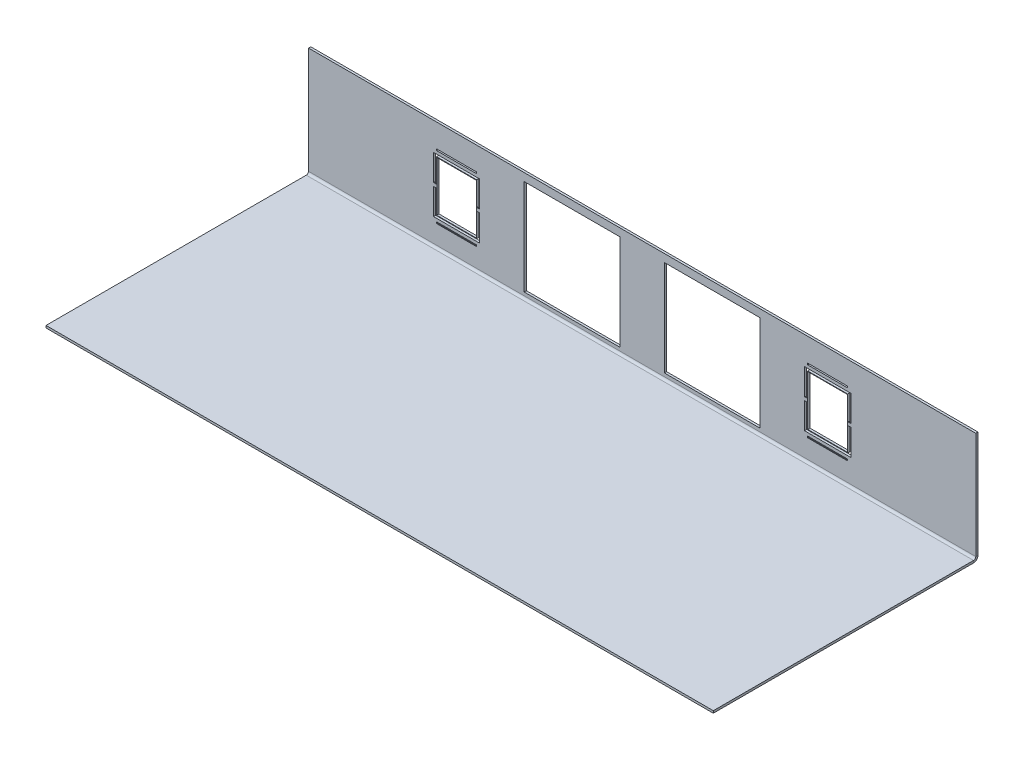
ISO-10303-21;
HEADER;
FILE_DESCRIPTION(('STEP AP214'),'2;1');
FILE_NAME('part.step','',(''),(''),'','','');
FILE_SCHEMA(('AUTOMOTIVE_DESIGN { 1 0 10303 214 1 1 1 1 }'));
ENDSEC;
DATA;
#1=APPLICATION_CONTEXT('core data for automotive mechanical design processes');
#2=APPLICATION_PROTOCOL_DEFINITION('international standard','automotive_design',2000,#1);
#3=PRODUCT_CONTEXT('',#1,'mechanical');
#4=PRODUCT('Part','Part','',(#3));
#5=PRODUCT_RELATED_PRODUCT_CATEGORY('part','',(#4));
#6=PRODUCT_DEFINITION_FORMATION('','',#4);
#7=PRODUCT_DEFINITION_CONTEXT('part definition',#1,'design');
#8=PRODUCT_DEFINITION('design','',#6,#7);
#9=PRODUCT_DEFINITION_SHAPE('','',#8);
#10=(LENGTH_UNIT() NAMED_UNIT(*) SI_UNIT(.MILLI.,.METRE.));
#11=(NAMED_UNIT(*) PLANE_ANGLE_UNIT() SI_UNIT($,.RADIAN.));
#12=(NAMED_UNIT(*) SI_UNIT($,.STERADIAN.) SOLID_ANGLE_UNIT());
#13=UNCERTAINTY_MEASURE_WITH_UNIT(LENGTH_MEASURE(1.E-05),#10,'distance_accuracy_value','');
#14=(GEOMETRIC_REPRESENTATION_CONTEXT(3) GLOBAL_UNCERTAINTY_ASSIGNED_CONTEXT((#13)) GLOBAL_UNIT_ASSIGNED_CONTEXT((#10,
#11,#12)) REPRESENTATION_CONTEXT('',''));
#15=CARTESIAN_POINT('',(0.,0.,0.));
#16=DIRECTION('',(0.,0.,1.));
#17=DIRECTION('',(1.,0.,0.));
#18=AXIS2_PLACEMENT_3D('',#15,#16,#17);
#19=CARTESIAN_POINT('',(150.,50.,1.));
#20=DIRECTION('',(0.,0.,-1.));
#21=DIRECTION('',(-1.,0.,0.));
#22=AXIS2_PLACEMENT_3D('',#19,#20,#21);
#23=PLANE('',#22);
#24=DIRECTION('',(0.,-1.,0.));
#25=VECTOR('',#24,1.);
#26=CARTESIAN_POINT('',(92.3,50.,1.));
#27=LINE('',#26,#25);
#28=CARTESIAN_POINT('',(92.3,36.2573189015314,1.));
#29=VERTEX_POINT('',#28);
#30=CARTESIAN_POINT('',(92.3,13.7573189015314,1.));
#31=VERTEX_POINT('',#30);
#32=EDGE_CURVE('E1314',#29,#31,#27,.T.);
#33=ORIENTED_EDGE('',*,*,#32,.T.);
#34=DIRECTION('',(-1.,0.,0.));
#35=VECTOR('',#34,1.);
#36=CARTESIAN_POINT('',(150.,13.7573189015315,1.));
#37=LINE('',#36,#35);
#38=CARTESIAN_POINT('',(74.45,13.7573189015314,1.));
#39=VERTEX_POINT('',#38);
#40=EDGE_CURVE('E1309',#31,#39,#37,.T.);
#41=ORIENTED_EDGE('',*,*,#40,.T.);
#42=DIRECTION('',(0.,1.,0.));
#43=VECTOR('',#42,1.);
#44=CARTESIAN_POINT('',(74.45,50.,1.));
#45=LINE('',#44,#43);
#46=CARTESIAN_POINT('',(74.45,36.2573189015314,1.));
#47=VERTEX_POINT('',#46);
#48=EDGE_CURVE('E510',#39,#47,#45,.T.);
#49=ORIENTED_EDGE('',*,*,#48,.T.);
#50=DIRECTION('',(1.,0.,0.));
#51=VECTOR('',#50,1.);
#52=CARTESIAN_POINT('',(150.,36.2573189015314,1.));
#53=LINE('',#52,#51);
#54=EDGE_CURVE('E508',#47,#29,#53,.T.);
#55=ORIENTED_EDGE('',*,*,#54,.T.);
#56=EDGE_LOOP('',(#33,#41,#49,#55));
#57=FACE_BOUND('',#56,.T.);
#58=DIRECTION('',(0.,1.,0.));
#59=VECTOR('',#58,1.);
#60=CARTESIAN_POINT('',(74.4,50.,1.));
#61=LINE('',#60,#59);
#62=CARTESIAN_POINT('',(74.4,25.74330348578,1.));
#63=VERTEX_POINT('',#62);
#64=CARTESIAN_POINT('',(74.4,36.5000000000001,1.));
#65=VERTEX_POINT('',#64);
#66=EDGE_CURVE('E1446',#63,#65,#61,.T.);
#67=ORIENTED_EDGE('',*,*,#66,.F.);
#68=DIRECTION('',(-1.,0.,0.));
#69=VECTOR('',#68,1.);
#70=CARTESIAN_POINT('',(93.8,25.74330348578,1.));
#71=LINE('',#70,#69);
#72=CARTESIAN_POINT('',(73.,25.74330348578,1.));
#73=VERTEX_POINT('',#72);
#74=EDGE_CURVE('E521',#73,#63,#71,.F.);
#75=ORIENTED_EDGE('',*,*,#74,.F.);
#76=DIRECTION('',(0.,1.,0.));
#77=VECTOR('',#76,1.);
#78=CARTESIAN_POINT('',(73.,50.,1.));
#79=LINE('',#78,#77);
#80=CARTESIAN_POINT('',(73.,37.5000000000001,1.));
#81=VERTEX_POINT('',#80);
#82=EDGE_CURVE('E1534',#73,#81,#79,.T.);
#83=ORIENTED_EDGE('',*,*,#82,.T.);
#84=DIRECTION('',(1.,0.,0.));
#85=VECTOR('',#84,1.);
#86=CARTESIAN_POINT('',(150.,37.5000000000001,1.));
#87=LINE('',#86,#85);
#88=CARTESIAN_POINT('',(93.8,37.5000000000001,1.));
#89=VERTEX_POINT('',#88);
#90=EDGE_CURVE('E1600',#81,#89,#87,.T.);
#91=ORIENTED_EDGE('',*,*,#90,.T.);
#92=DIRECTION('',(0.,-1.,0.));
#93=VECTOR('',#92,1.);
#94=CARTESIAN_POINT('',(93.8,50.,1.));
#95=LINE('',#94,#93);
#96=CARTESIAN_POINT('',(93.8,25.74330348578,1.));
#97=VERTEX_POINT('',#96);
#98=EDGE_CURVE('E1603',#89,#97,#95,.T.);
#99=ORIENTED_EDGE('',*,*,#98,.T.);
#100=DIRECTION('',(-1.,0.,0.));
#101=VECTOR('',#100,1.);
#102=CARTESIAN_POINT('',(93.8,25.74330348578,1.));
#103=LINE('',#102,#101);
#104=CARTESIAN_POINT('',(92.4,25.74330348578,1.));
#105=VERTEX_POINT('',#104);
#106=EDGE_CURVE('E523',#105,#97,#103,.F.);
#107=ORIENTED_EDGE('',*,*,#106,.F.);
#108=DIRECTION('',(0.,-1.,0.));
#109=VECTOR('',#108,1.);
#110=CARTESIAN_POINT('',(92.4,50.,1.));
#111=LINE('',#110,#109);
#112=CARTESIAN_POINT('',(92.4,36.5000000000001,1.));
#113=VERTEX_POINT('',#112);
#114=EDGE_CURVE('E1595',#113,#105,#111,.T.);
#115=ORIENTED_EDGE('',*,*,#114,.F.);
#116=DIRECTION('',(1.,0.,0.));
#117=VECTOR('',#116,1.);
#118=CARTESIAN_POINT('',(150.,36.5000000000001,1.));
#119=LINE('',#118,#117);
#120=EDGE_CURVE('E1440',#65,#113,#119,.T.);
#121=ORIENTED_EDGE('',*,*,#120,.F.);
#122=EDGE_LOOP('',(#67,#75,#83,#91,#99,#107,#115,#121));
#123=FACE_BOUND('',#122,.T.);
#124=DIRECTION('',(-1.,0.,0.));
#125=VECTOR('',#124,1.);
#126=CARTESIAN_POINT('',(150.,39.5457050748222,1.));
#127=LINE('',#126,#125);
#128=CARTESIAN_POINT('',(-74.4000000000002,39.5457050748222,1.));
#129=VERTEX_POINT('',#128);
#130=CARTESIAN_POINT('',(-92.4000000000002,39.5457050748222,1.));
#131=VERTEX_POINT('',#130);
#132=EDGE_CURVE('E551',#129,#131,#127,.T.);
#133=ORIENTED_EDGE('',*,*,#132,.F.);
#134=DIRECTION('',(0.,1.,0.));
#135=VECTOR('',#134,1.);
#136=CARTESIAN_POINT('',(-74.4000000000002,50.,1.));
#137=LINE('',#136,#135);
#138=CARTESIAN_POINT('',(-74.4000000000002,38.8586231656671,1.));
#139=VERTEX_POINT('',#138);
#140=EDGE_CURVE('E728',#139,#129,#137,.T.);
#141=ORIENTED_EDGE('',*,*,#140,.F.);
#142=DIRECTION('',(1.,0.,0.));
#143=VECTOR('',#142,1.);
#144=CARTESIAN_POINT('',(150.,38.8586231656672,1.));
#145=LINE('',#144,#143);
#146=CARTESIAN_POINT('',(-92.4000000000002,38.8586231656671,1.));
#147=VERTEX_POINT('',#146);
#148=EDGE_CURVE('E723',#147,#139,#145,.T.);
#149=ORIENTED_EDGE('',*,*,#148,.F.);
#150=DIRECTION('',(0.,-1.,0.));
#151=VECTOR('',#150,1.);
#152=CARTESIAN_POINT('',(-92.4000000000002,50.,1.));
#153=LINE('',#152,#151);
#154=EDGE_CURVE('E725',#131,#147,#153,.T.);
#155=ORIENTED_EDGE('',*,*,#154,.F.);
#156=EDGE_LOOP('',(#133,#141,#149,#155));
#157=FACE_BOUND('',#156,.T.);
#158=DIRECTION('',(1.,0.,0.));
#159=VECTOR('',#158,1.);
#160=CARTESIAN_POINT('',(150.,11.141376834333,1.));
#161=LINE('',#160,#159);
#162=CARTESIAN_POINT('',(-92.4000000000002,11.141376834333,1.));
#163=VERTEX_POINT('',#162);
#164=CARTESIAN_POINT('',(-74.4000000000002,11.141376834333,1.));
#165=VERTEX_POINT('',#164);
#166=EDGE_CURVE('E720',#163,#165,#161,.T.);
#167=ORIENTED_EDGE('',*,*,#166,.T.);
#168=DIRECTION('',(0.,-1.,0.));
#169=VECTOR('',#168,1.);
#170=CARTESIAN_POINT('',(-74.4000000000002,50.,1.));
#171=LINE('',#170,#169);
#172=CARTESIAN_POINT('',(-74.4000000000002,10.454294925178,1.));
#173=VERTEX_POINT('',#172);
#174=EDGE_CURVE('E713',#165,#173,#171,.T.);
#175=ORIENTED_EDGE('',*,*,#174,.T.);
#176=DIRECTION('',(-1.,0.,0.));
#177=VECTOR('',#176,1.);
#178=CARTESIAN_POINT('',(150.,10.4542949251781,1.));
#179=LINE('',#178,#177);
#180=CARTESIAN_POINT('',(-92.4000000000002,10.454294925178,1.));
#181=VERTEX_POINT('',#180);
#182=EDGE_CURVE('E553',#173,#181,#179,.T.);
#183=ORIENTED_EDGE('',*,*,#182,.T.);
#184=DIRECTION('',(0.,1.,0.));
#185=VECTOR('',#184,1.);
#186=CARTESIAN_POINT('',(-92.4000000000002,50.,1.));
#187=LINE('',#186,#185);
#188=EDGE_CURVE('E710',#181,#163,#187,.T.);
#189=ORIENTED_EDGE('',*,*,#188,.T.);
#190=EDGE_LOOP('',(#167,#175,#183,#189));
#191=FACE_BOUND('',#190,.T.);
#192=DIRECTION('',(0.,-1.,0.));
#193=VECTOR('',#192,1.);
#194=CARTESIAN_POINT('',(-74.4000000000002,50.,1.));
#195=LINE('',#194,#193);
#196=CARTESIAN_POINT('',(-74.4000000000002,36.5000000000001,1.));
#197=VERTEX_POINT('',#196);
#198=CARTESIAN_POINT('',(-74.4000000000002,25.7433034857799,0.999999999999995));
#199=VERTEX_POINT('',#198);
#200=EDGE_CURVE('E662',#197,#199,#195,.T.);
#201=ORIENTED_EDGE('',*,*,#200,.F.);
#202=DIRECTION('',(1.,0.,0.));
#203=VECTOR('',#202,1.);
#204=CARTESIAN_POINT('',(150.,36.5000000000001,1.));
#205=LINE('',#204,#203);
#206=CARTESIAN_POINT('',(-92.4000000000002,36.5000000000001,1.));
#207=VERTEX_POINT('',#206);
#208=EDGE_CURVE('E665',#207,#197,#205,.T.);
#209=ORIENTED_EDGE('',*,*,#208,.F.);
#210=DIRECTION('',(0.,1.,0.));
#211=VECTOR('',#210,1.);
#212=CARTESIAN_POINT('',(-92.4000000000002,50.,1.));
#213=LINE('',#212,#211);
#214=CARTESIAN_POINT('',(-92.4000000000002,25.7433034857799,1.));
#215=VERTEX_POINT('',#214);
#216=EDGE_CURVE('E707',#215,#207,#213,.T.);
#217=ORIENTED_EDGE('',*,*,#216,.F.);
#218=DIRECTION('',(1.,0.,0.));
#219=VECTOR('',#218,1.);
#220=CARTESIAN_POINT('',(-93.8000000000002,25.7433034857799,1.));
#221=LINE('',#220,#219);
#222=CARTESIAN_POINT('',(-93.8000000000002,25.7433034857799,1.));
#223=VERTEX_POINT('',#222);
#224=EDGE_CURVE('E563',#223,#215,#221,.T.);
#225=ORIENTED_EDGE('',*,*,#224,.F.);
#226=DIRECTION('',(0.,1.,0.));
#227=VECTOR('',#226,1.);
#228=CARTESIAN_POINT('',(-93.8000000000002,50.,1.));
#229=LINE('',#228,#227);
#230=CARTESIAN_POINT('',(-93.8000000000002,37.5000000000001,1.));
#231=VERTEX_POINT('',#230);
#232=EDGE_CURVE('E683',#223,#231,#229,.T.);
#233=ORIENTED_EDGE('',*,*,#232,.T.);
#234=DIRECTION('',(1.,0.,0.));
#235=VECTOR('',#234,1.);
#236=CARTESIAN_POINT('',(150.,37.5000000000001,1.));
#237=LINE('',#236,#235);
#238=CARTESIAN_POINT('',(-73.0000000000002,37.5000000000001,1.));
#239=VERTEX_POINT('',#238);
#240=EDGE_CURVE('E704',#231,#239,#237,.T.);
#241=ORIENTED_EDGE('',*,*,#240,.T.);
#242=DIRECTION('',(0.,-1.,0.));
#243=VECTOR('',#242,1.);
#244=CARTESIAN_POINT('',(-73.0000000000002,50.,1.));
#245=LINE('',#244,#243);
#246=CARTESIAN_POINT('',(-73.0000000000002,25.7433034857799,1.));
#247=VERTEX_POINT('',#246);
#248=EDGE_CURVE('E719',#239,#247,#245,.T.);
#249=ORIENTED_EDGE('',*,*,#248,.T.);
#250=DIRECTION('',(1.,0.,0.));
#251=VECTOR('',#250,1.);
#252=CARTESIAN_POINT('',(-93.8000000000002,25.7433034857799,1.));
#253=LINE('',#252,#251);
#254=EDGE_CURVE('E561',#199,#247,#253,.T.);
#255=ORIENTED_EDGE('',*,*,#254,.F.);
#256=EDGE_LOOP('',(#201,#209,#217,#225,#233,#241,#249,#255));
#257=FACE_BOUND('',#256,.T.);
#258=DIRECTION('',(0.,-1.,0.));
#259=VECTOR('',#258,1.);
#260=CARTESIAN_POINT('',(-150.,50.,1.));
#261=LINE('',#260,#259);
#262=CARTESIAN_POINT('',(-150.,50.,0.999999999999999));
#263=VERTEX_POINT('',#262);
#264=CARTESIAN_POINT('',(-150.,1.99999999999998,1.));
#265=VERTEX_POINT('',#264);
#266=EDGE_CURVE('E589',#263,#265,#261,.T.);
#267=ORIENTED_EDGE('',*,*,#266,.T.);
#268=DIRECTION('',(1.,0.,0.));
#269=VECTOR('',#268,1.);
#270=CARTESIAN_POINT('',(150.,2.,1.));
#271=LINE('',#270,#269);
#272=CARTESIAN_POINT('',(150.,1.99999999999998,1.));
#273=VERTEX_POINT('',#272);
#274=EDGE_CURVE('E586',#265,#273,#271,.T.);
#275=ORIENTED_EDGE('',*,*,#274,.T.);
#276=DIRECTION('',(0.,-1.,0.));
#277=VECTOR('',#276,1.);
#278=CARTESIAN_POINT('',(150.,50.,1.));
#279=LINE('',#278,#277);
#280=CARTESIAN_POINT('',(150.,50.,1.));
#281=VERTEX_POINT('',#280);
#282=EDGE_CURVE('E597',#281,#273,#279,.T.);
#283=ORIENTED_EDGE('',*,*,#282,.F.);
#284=DIRECTION('',(1.,0.,0.));
#285=VECTOR('',#284,1.);
#286=CARTESIAN_POINT('',(150.,50.,1.));
#287=LINE('',#286,#285);
#288=EDGE_CURVE('E594',#263,#281,#287,.T.);
#289=ORIENTED_EDGE('',*,*,#288,.F.);
#290=EDGE_LOOP('',(#267,#275,#283,#289));
#291=FACE_BOUND('',#290,.T.);
#292=CARTESIAN_POINT('',(-74.4000000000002,24.2566965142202,0.999999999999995));
#293=VERTEX_POINT('',#292);
#294=CARTESIAN_POINT('',(-74.4000000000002,13.5000000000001,1.));
#295=VERTEX_POINT('',#294);
#296=EDGE_CURVE('E663',#293,#295,#195,.T.);
#297=ORIENTED_EDGE('',*,*,#296,.F.);
#298=DIRECTION('',(1.,0.,0.));
#299=VECTOR('',#298,1.);
#300=CARTESIAN_POINT('',(-93.8000000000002,24.2566965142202,1.));
#301=LINE('',#300,#299);
#302=CARTESIAN_POINT('',(-73.0000000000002,24.2566965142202,1.));
#303=VERTEX_POINT('',#302);
#304=EDGE_CURVE('E556',#303,#293,#301,.F.);
#305=ORIENTED_EDGE('',*,*,#304,.F.);
#306=CARTESIAN_POINT('',(-73.0000000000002,12.5000000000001,1.));
#307=VERTEX_POINT('',#306);
#308=EDGE_CURVE('E716',#303,#307,#245,.T.);
#309=ORIENTED_EDGE('',*,*,#308,.T.);
#310=DIRECTION('',(-1.,0.,0.));
#311=VECTOR('',#310,1.);
#312=CARTESIAN_POINT('',(150.,12.5000000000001,1.));
#313=LINE('',#312,#311);
#314=CARTESIAN_POINT('',(-93.8000000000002,12.5000000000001,1.));
#315=VERTEX_POINT('',#314);
#316=EDGE_CURVE('E701',#307,#315,#313,.T.);
#317=ORIENTED_EDGE('',*,*,#316,.T.);
#318=CARTESIAN_POINT('',(-93.8000000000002,24.2566965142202,1.));
#319=VERTEX_POINT('',#318);
#320=EDGE_CURVE('E700',#315,#319,#229,.T.);
#321=ORIENTED_EDGE('',*,*,#320,.T.);
#322=DIRECTION('',(1.,0.,0.));
#323=VECTOR('',#322,1.);
#324=CARTESIAN_POINT('',(-93.8000000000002,24.2566965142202,1.));
#325=LINE('',#324,#323);
#326=CARTESIAN_POINT('',(-92.4000000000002,24.2566965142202,1.));
#327=VERTEX_POINT('',#326);
#328=EDGE_CURVE('E558',#327,#319,#325,.F.);
#329=ORIENTED_EDGE('',*,*,#328,.F.);
#330=CARTESIAN_POINT('',(-92.4000000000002,13.5000000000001,1.));
#331=VERTEX_POINT('',#330);
#332=EDGE_CURVE('E709',#331,#327,#213,.T.);
#333=ORIENTED_EDGE('',*,*,#332,.F.);
#334=DIRECTION('',(-1.,0.,0.));
#335=VECTOR('',#334,1.);
#336=CARTESIAN_POINT('',(150.,13.5000000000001,1.));
#337=LINE('',#336,#335);
#338=EDGE_CURVE('E667',#295,#331,#337,.T.);
#339=ORIENTED_EDGE('',*,*,#338,.F.);
#340=EDGE_LOOP('',(#297,#305,#309,#317,#321,#329,#333,#339));
#341=FACE_BOUND('',#340,.T.);
#342=DIRECTION('',(0.,1.,0.));
#343=VECTOR('',#342,1.);
#344=CARTESIAN_POINT('',(-92.3000000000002,50.,1.));
#345=LINE('',#344,#343);
#346=CARTESIAN_POINT('',(-92.3000000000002,13.7426810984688,1.));
#347=VERTEX_POINT('',#346);
#348=CARTESIAN_POINT('',(-92.3000000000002,36.2426810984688,1.));
#349=VERTEX_POINT('',#348);
#350=EDGE_CURVE('E1035',#347,#349,#345,.T.);
#351=ORIENTED_EDGE('',*,*,#350,.T.);
#352=DIRECTION('',(1.,0.,0.));
#353=VECTOR('',#352,1.);
#354=CARTESIAN_POINT('',(150.,36.2426810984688,1.));
#355=LINE('',#354,#353);
#356=CARTESIAN_POINT('',(-74.4500000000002,36.2426810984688,1.));
#357=VERTEX_POINT('',#356);
#358=EDGE_CURVE('E1032',#349,#357,#355,.T.);
#359=ORIENTED_EDGE('',*,*,#358,.T.);
#360=DIRECTION('',(0.,-1.,0.));
#361=VECTOR('',#360,1.);
#362=CARTESIAN_POINT('',(-74.4500000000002,50.,1.));
#363=LINE('',#362,#361);
#364=CARTESIAN_POINT('',(-74.4500000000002,13.7426810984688,1.));
#365=VERTEX_POINT('',#364);
#366=EDGE_CURVE('E1240',#357,#365,#363,.T.);
#367=ORIENTED_EDGE('',*,*,#366,.T.);
#368=DIRECTION('',(-1.,0.,0.));
#369=VECTOR('',#368,1.);
#370=CARTESIAN_POINT('',(150.,13.7426810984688,1.));
#371=LINE('',#370,#369);
#372=EDGE_CURVE('E1258',#365,#347,#371,.T.);
#373=ORIENTED_EDGE('',*,*,#372,.T.);
#374=EDGE_LOOP('',(#351,#359,#367,#373));
#375=FACE_BOUND('',#374,.T.);
#376=DIRECTION('',(0.,-1.,0.));
#377=VECTOR('',#376,1.);
#378=CARTESIAN_POINT('',(-10.0000000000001,50.,1.));
#379=LINE('',#378,#377);
#380=CARTESIAN_POINT('',(-10.0000000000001,46.499998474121,1.));
#381=VERTEX_POINT('',#380);
#382=CARTESIAN_POINT('',(-10.0000000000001,3.49999847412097,1.));
#383=VERTEX_POINT('',#382);
#384=EDGE_CURVE('E1274',#381,#383,#379,.T.);
#385=ORIENTED_EDGE('',*,*,#384,.T.);
#386=DIRECTION('',(-1.,0.,0.));
#387=VECTOR('',#386,1.);
#388=CARTESIAN_POINT('',(150.,3.49999847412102,1.));
#389=LINE('',#388,#387);
#390=CARTESIAN_POINT('',(-53.0000000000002,3.49999847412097,1.));
#391=VERTEX_POINT('',#390);
#392=EDGE_CURVE('E1253',#383,#391,#389,.T.);
#393=ORIENTED_EDGE('',*,*,#392,.T.);
#394=DIRECTION('',(0.,1.,0.));
#395=VECTOR('',#394,1.);
#396=CARTESIAN_POINT('',(-53.0000000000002,50.,1.));
#397=LINE('',#396,#395);
#398=CARTESIAN_POINT('',(-53.0000000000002,46.499998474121,1.));
#399=VERTEX_POINT('',#398);
#400=EDGE_CURVE('E1496',#391,#399,#397,.T.);
#401=ORIENTED_EDGE('',*,*,#400,.T.);
#402=DIRECTION('',(1.,0.,0.));
#403=VECTOR('',#402,1.);
#404=CARTESIAN_POINT('',(150.,46.499998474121,1.));
#405=LINE('',#404,#403);
#406=EDGE_CURVE('E1505',#399,#381,#405,.T.);
#407=ORIENTED_EDGE('',*,*,#406,.T.);
#408=EDGE_LOOP('',(#385,#393,#401,#407));
#409=FACE_BOUND('',#408,.T.);
#410=DIRECTION('',(0.,-1.,0.));
#411=VECTOR('',#410,1.);
#412=CARTESIAN_POINT('',(53.,50.,1.));
#413=LINE('',#412,#411);
#414=CARTESIAN_POINT('',(53.,46.499998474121,1.));
#415=VERTEX_POINT('',#414);
#416=CARTESIAN_POINT('',(53.,3.49999847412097,1.));
#417=VERTEX_POINT('',#416);
#418=EDGE_CURVE('E1279',#415,#417,#413,.T.);
#419=ORIENTED_EDGE('',*,*,#418,.T.);
#420=DIRECTION('',(-1.,0.,0.));
#421=VECTOR('',#420,1.);
#422=CARTESIAN_POINT('',(150.,3.49999847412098,1.));
#423=LINE('',#422,#421);
#424=CARTESIAN_POINT('',(10.,3.49999847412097,1.));
#425=VERTEX_POINT('',#424);
#426=EDGE_CURVE('E1477',#417,#425,#423,.T.);
#427=ORIENTED_EDGE('',*,*,#426,.T.);
#428=DIRECTION('',(0.,1.,0.));
#429=VECTOR('',#428,1.);
#430=CARTESIAN_POINT('',(10.,50.,1.));
#431=LINE('',#430,#429);
#432=CARTESIAN_POINT('',(10.,46.499998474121,1.));
#433=VERTEX_POINT('',#432);
#434=EDGE_CURVE('E1464',#425,#433,#431,.T.);
#435=ORIENTED_EDGE('',*,*,#434,.T.);
#436=DIRECTION('',(1.,0.,0.));
#437=VECTOR('',#436,1.);
#438=CARTESIAN_POINT('',(150.,46.499998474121,1.));
#439=LINE('',#438,#437);
#440=EDGE_CURVE('E1474',#433,#415,#439,.T.);
#441=ORIENTED_EDGE('',*,*,#440,.T.);
#442=EDGE_LOOP('',(#419,#427,#435,#441));
#443=FACE_BOUND('',#442,.T.);
#444=CARTESIAN_POINT('',(74.4,13.5000000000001,1.));
#445=VERTEX_POINT('',#444);
#446=CARTESIAN_POINT('',(74.4,24.2566965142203,1.));
#447=VERTEX_POINT('',#446);
#448=EDGE_CURVE('E1284',#445,#447,#61,.T.);
#449=ORIENTED_EDGE('',*,*,#448,.F.);
#450=DIRECTION('',(-1.,0.,0.));
#451=VECTOR('',#450,1.);
#452=CARTESIAN_POINT('',(150.,13.5000000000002,1.));
#453=LINE('',#452,#451);
#454=CARTESIAN_POINT('',(92.4,13.5000000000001,1.));
#455=VERTEX_POINT('',#454);
#456=EDGE_CURVE('E1442',#455,#445,#453,.T.);
#457=ORIENTED_EDGE('',*,*,#456,.F.);
#458=CARTESIAN_POINT('',(92.4,24.2566965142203,1.));
#459=VERTEX_POINT('',#458);
#460=EDGE_CURVE('E1596',#459,#455,#111,.T.);
#461=ORIENTED_EDGE('',*,*,#460,.F.);
#462=DIRECTION('',(-1.,0.,0.));
#463=VECTOR('',#462,1.);
#464=CARTESIAN_POINT('',(93.8,24.2566965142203,1.));
#465=LINE('',#464,#463);
#466=CARTESIAN_POINT('',(93.8,24.2566965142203,1.));
#467=VERTEX_POINT('',#466);
#468=EDGE_CURVE('E528',#467,#459,#465,.T.);
#469=ORIENTED_EDGE('',*,*,#468,.F.);
#470=CARTESIAN_POINT('',(93.8,12.5000000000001,1.));
#471=VERTEX_POINT('',#470);
#472=EDGE_CURVE('E1604',#467,#471,#95,.T.);
#473=ORIENTED_EDGE('',*,*,#472,.T.);
#474=DIRECTION('',(-1.,0.,0.));
#475=VECTOR('',#474,1.);
#476=CARTESIAN_POINT('',(150.,12.5000000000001,1.));
#477=LINE('',#476,#475);
#478=CARTESIAN_POINT('',(73.,12.5000000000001,1.));
#479=VERTEX_POINT('',#478);
#480=EDGE_CURVE('E1532',#471,#479,#477,.T.);
#481=ORIENTED_EDGE('',*,*,#480,.T.);
#482=CARTESIAN_POINT('',(73.,24.2566965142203,1.));
#483=VERTEX_POINT('',#482);
#484=EDGE_CURVE('E1529',#479,#483,#79,.T.);
#485=ORIENTED_EDGE('',*,*,#484,.T.);
#486=DIRECTION('',(-1.,0.,0.));
#487=VECTOR('',#486,1.);
#488=CARTESIAN_POINT('',(93.8,24.2566965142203,1.));
#489=LINE('',#488,#487);
#490=EDGE_CURVE('E526',#447,#483,#489,.T.);
#491=ORIENTED_EDGE('',*,*,#490,.F.);
#492=EDGE_LOOP('',(#449,#457,#461,#469,#473,#481,#485,#491));
#493=FACE_BOUND('',#492,.T.);
#494=DIRECTION('',(-1.,0.,0.));
#495=VECTOR('',#494,1.);
#496=CARTESIAN_POINT('',(150.,38.8586231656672,1.));
#497=LINE('',#496,#495);
#498=CARTESIAN_POINT('',(92.4,38.8586231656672,1.));
#499=VERTEX_POINT('',#498);
#500=CARTESIAN_POINT('',(74.4,38.8586231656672,1.));
#501=VERTEX_POINT('',#500);
#502=EDGE_CURVE('E1290',#499,#501,#497,.T.);
#503=ORIENTED_EDGE('',*,*,#502,.T.);
#504=DIRECTION('',(0.,1.,0.));
#505=VECTOR('',#504,1.);
#506=CARTESIAN_POINT('',(74.4,50.,1.));
#507=LINE('',#506,#505);
#508=CARTESIAN_POINT('',(74.4,39.5457050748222,1.));
#509=VERTEX_POINT('',#508);
#510=EDGE_CURVE('E1539',#501,#509,#507,.T.);
#511=ORIENTED_EDGE('',*,*,#510,.T.);
#512=DIRECTION('',(1.,0.,0.));
#513=VECTOR('',#512,1.);
#514=CARTESIAN_POINT('',(150.,39.5457050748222,1.));
#515=LINE('',#514,#513);
#516=CARTESIAN_POINT('',(92.4,39.5457050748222,1.));
#517=VERTEX_POINT('',#516);
#518=EDGE_CURVE('E518',#509,#517,#515,.T.);
#519=ORIENTED_EDGE('',*,*,#518,.T.);
#520=DIRECTION('',(0.,-1.,0.));
#521=VECTOR('',#520,1.);
#522=CARTESIAN_POINT('',(92.4,50.,1.));
#523=LINE('',#522,#521);
#524=EDGE_CURVE('E1594',#517,#499,#523,.T.);
#525=ORIENTED_EDGE('',*,*,#524,.T.);
#526=EDGE_LOOP('',(#503,#511,#519,#525));
#527=FACE_BOUND('',#526,.T.);
#528=DIRECTION('',(1.,0.,0.));
#529=VECTOR('',#528,1.);
#530=CARTESIAN_POINT('',(150.,10.4542949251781,1.));
#531=LINE('',#530,#529);
#532=CARTESIAN_POINT('',(74.4,10.4542949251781,1.));
#533=VERTEX_POINT('',#532);
#534=CARTESIAN_POINT('',(92.4,10.4542949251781,1.));
#535=VERTEX_POINT('',#534);
#536=EDGE_CURVE('E501',#533,#535,#531,.T.);
#537=ORIENTED_EDGE('',*,*,#536,.F.);
#538=DIRECTION('',(0.,-1.,0.));
#539=VECTOR('',#538,1.);
#540=CARTESIAN_POINT('',(74.4,50.,1.));
#541=LINE('',#540,#539);
#542=CARTESIAN_POINT('',(74.4,11.1413768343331,0.999999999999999));
#543=VERTEX_POINT('',#542);
#544=EDGE_CURVE('E1295',#543,#533,#541,.T.);
#545=ORIENTED_EDGE('',*,*,#544,.F.);
#546=DIRECTION('',(-1.,0.,0.));
#547=VECTOR('',#546,1.);
#548=CARTESIAN_POINT('',(150.,11.1413768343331,1.));
#549=LINE('',#548,#547);
#550=CARTESIAN_POINT('',(92.4,11.1413768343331,1.));
#551=VERTEX_POINT('',#550);
#552=EDGE_CURVE('E1536',#551,#543,#549,.T.);
#553=ORIENTED_EDGE('',*,*,#552,.F.);
#554=DIRECTION('',(0.,1.,0.));
#555=VECTOR('',#554,1.);
#556=CARTESIAN_POINT('',(92.4,50.,1.));
#557=LINE('',#556,#555);
#558=EDGE_CURVE('E1297',#535,#551,#557,.T.);
#559=ORIENTED_EDGE('',*,*,#558,.F.);
#560=EDGE_LOOP('',(#537,#545,#553,#559));
#561=FACE_BOUND('',#560,.T.);
#562=ADVANCED_FACE('F26',(#57,#123,#157,#191,#257,#291,#341,#375,#409,#443,#493,#527,#561),#23,.F.);
#563=CARTESIAN_POINT('',(-150.,1.,0.));
#564=DIRECTION('',(0.,0.,1.));
#565=DIRECTION('',(1.,0.,0.));
#566=AXIS2_PLACEMENT_3D('',#563,#564,#565);
#567=PLANE('',#566);
#568=DIRECTION('',(0.,-1.,0.));
#569=VECTOR('',#568,1.);
#570=CARTESIAN_POINT('',(10.,46.499998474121,0.));
#571=LINE('',#570,#569);
#572=CARTESIAN_POINT('',(10.,46.499998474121,0.));
#573=VERTEX_POINT('',#572);
#574=CARTESIAN_POINT('',(10.,3.49999847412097,0.));
#575=VERTEX_POINT('',#574);
#576=EDGE_CURVE('E1452',#573,#575,#571,.T.);
#577=ORIENTED_EDGE('',*,*,#576,.T.);
#578=DIRECTION('',(1.,0.,0.));
#579=VECTOR('',#578,1.);
#580=CARTESIAN_POINT('',(10.,3.49999847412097,0.));
#581=LINE('',#580,#579);
#582=CARTESIAN_POINT('',(53.,3.49999847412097,0.));
#583=VERTEX_POINT('',#582);
#584=EDGE_CURVE('E1456',#575,#583,#581,.T.);
#585=ORIENTED_EDGE('',*,*,#584,.T.);
#586=DIRECTION('',(0.,1.,0.));
#587=VECTOR('',#586,1.);
#588=CARTESIAN_POINT('',(53.,3.49999847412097,0.));
#589=LINE('',#588,#587);
#590=CARTESIAN_POINT('',(53.,46.499998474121,0.));
#591=VERTEX_POINT('',#590);
#592=EDGE_CURVE('E1457',#583,#591,#589,.T.);
#593=ORIENTED_EDGE('',*,*,#592,.T.);
#594=DIRECTION('',(-1.,0.,0.));
#595=VECTOR('',#594,1.);
#596=CARTESIAN_POINT('',(53.,46.499998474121,0.));
#597=LINE('',#596,#595);
#598=EDGE_CURVE('E1448',#591,#573,#597,.T.);
#599=ORIENTED_EDGE('',*,*,#598,.T.);
#600=EDGE_LOOP('',(#577,#585,#593,#599));
#601=FACE_BOUND('',#600,.T.);
#602=DIRECTION('',(0.,-1.,0.));
#603=VECTOR('',#602,1.);
#604=CARTESIAN_POINT('',(-53.0000000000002,46.499998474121,0.));
#605=LINE('',#604,#603);
#606=CARTESIAN_POINT('',(-53.0000000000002,46.499998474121,0.));
#607=VERTEX_POINT('',#606);
#608=CARTESIAN_POINT('',(-53.0000000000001,3.49999847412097,0.));
#609=VERTEX_POINT('',#608);
#610=EDGE_CURVE('E1484',#607,#609,#605,.T.);
#611=ORIENTED_EDGE('',*,*,#610,.T.);
#612=DIRECTION('',(1.,0.,0.));
#613=VECTOR('',#612,1.);
#614=CARTESIAN_POINT('',(-53.0000000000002,3.49999847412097,0.));
#615=LINE('',#614,#613);
#616=CARTESIAN_POINT('',(-10.0000000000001,3.49999847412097,0.));
#617=VERTEX_POINT('',#616);
#618=EDGE_CURVE('E1488',#609,#617,#615,.T.);
#619=ORIENTED_EDGE('',*,*,#618,.T.);
#620=DIRECTION('',(0.,1.,0.));
#621=VECTOR('',#620,1.);
#622=CARTESIAN_POINT('',(-10.0000000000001,3.49999847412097,0.));
#623=LINE('',#622,#621);
#624=CARTESIAN_POINT('',(-10.0000000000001,46.499998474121,0.));
#625=VERTEX_POINT('',#624);
#626=EDGE_CURVE('E1489',#617,#625,#623,.T.);
#627=ORIENTED_EDGE('',*,*,#626,.T.);
#628=DIRECTION('',(-1.,0.,0.));
#629=VECTOR('',#628,1.);
#630=CARTESIAN_POINT('',(-10.0000000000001,46.499998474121,0.));
#631=LINE('',#630,#629);
#632=EDGE_CURVE('E1480',#625,#607,#631,.T.);
#633=ORIENTED_EDGE('',*,*,#632,.T.);
#634=EDGE_LOOP('',(#611,#619,#627,#633));
#635=FACE_BOUND('',#634,.T.);
#636=DIRECTION('',(-1.,0.,0.));
#637=VECTOR('',#636,1.);
#638=CARTESIAN_POINT('',(-73.0000000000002,12.5000000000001,0.));
#639=LINE('',#638,#637);
#640=CARTESIAN_POINT('',(-93.8000000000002,12.5000000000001,0.));
#641=VERTEX_POINT('',#640);
#642=CARTESIAN_POINT('',(-73.0000000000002,12.5000000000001,0.));
#643=VERTEX_POINT('',#642);
#644=EDGE_CURVE('E782',#641,#643,#639,.F.);
#645=ORIENTED_EDGE('',*,*,#644,.T.);
#646=DIRECTION('',(0.,-1.,0.));
#647=VECTOR('',#646,1.);
#648=CARTESIAN_POINT('',(-73.0000000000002,25.0000000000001,0.));
#649=LINE('',#648,#647);
#650=CARTESIAN_POINT('',(-73.0000000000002,37.5000000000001,0.));
#651=VERTEX_POINT('',#650);
#652=EDGE_CURVE('E783',#643,#651,#649,.F.);
#653=ORIENTED_EDGE('',*,*,#652,.T.);
#654=DIRECTION('',(-1.,0.,0.));
#655=VECTOR('',#654,1.);
#656=CARTESIAN_POINT('',(-83.4000000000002,37.5000000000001,0.));
#657=LINE('',#656,#655);
#658=CARTESIAN_POINT('',(-93.8000000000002,37.5000000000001,0.));
#659=VERTEX_POINT('',#658);
#660=EDGE_CURVE('E779',#651,#659,#657,.T.);
#661=ORIENTED_EDGE('',*,*,#660,.T.);
#662=DIRECTION('',(0.,1.,0.));
#663=VECTOR('',#662,1.);
#664=CARTESIAN_POINT('',(-93.8000000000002,12.5000000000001,0.));
#665=LINE('',#664,#663);
#666=EDGE_CURVE('E809',#659,#641,#665,.F.);
#667=ORIENTED_EDGE('',*,*,#666,.T.);
#668=EDGE_LOOP('',(#645,#653,#661,#667));
#669=FACE_BOUND('',#668,.T.);
#670=DIRECTION('',(-1.,0.,0.));
#671=VECTOR('',#670,1.);
#672=CARTESIAN_POINT('',(-83.4000000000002,10.4999997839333,0.));
#673=LINE('',#672,#671);
#674=CARTESIAN_POINT('',(-92.4000000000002,10.4999997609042,0.));
#675=VERTEX_POINT('',#674);
#676=CARTESIAN_POINT('',(-74.4000000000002,10.4999997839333,-1.89989725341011E-07));
#677=VERTEX_POINT('',#676);
#678=EDGE_CURVE('E789',#675,#677,#673,.F.);
#679=ORIENTED_EDGE('',*,*,#678,.T.);
#680=DIRECTION('',(0.,-1.,0.));
#681=VECTOR('',#680,1.);
#682=CARTESIAN_POINT('',(-74.4000000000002,25.0000000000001,0.));
#683=LINE('',#682,#681);
#684=CARTESIAN_POINT('',(-74.4000000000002,11.3227060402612,-6.33298725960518E-08));
#685=VERTEX_POINT('',#684);
#686=EDGE_CURVE('E786',#677,#685,#683,.F.);
#687=ORIENTED_EDGE('',*,*,#686,.T.);
#688=DIRECTION('',(-1.,0.,0.));
#689=VECTOR('',#688,1.);
#690=CARTESIAN_POINT('',(-83.4000000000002,11.3227060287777,0.));
#691=LINE('',#690,#689);
#692=CARTESIAN_POINT('',(-92.4000000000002,11.3227060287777,0.));
#693=VERTEX_POINT('',#692);
#694=EDGE_CURVE('E795',#685,#693,#691,.T.);
#695=ORIENTED_EDGE('',*,*,#694,.T.);
#696=DIRECTION('',(0.,-1.,0.));
#697=VECTOR('',#696,1.);
#698=CARTESIAN_POINT('',(-92.4000000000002,25.0000000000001,0.));
#699=LINE('',#698,#697);
#700=EDGE_CURVE('E792',#693,#675,#699,.T.);
#701=ORIENTED_EDGE('',*,*,#700,.T.);
#702=EDGE_LOOP('',(#679,#687,#695,#701));
#703=FACE_BOUND('',#702,.T.);
#704=DIRECTION('',(-1.,0.,0.));
#705=VECTOR('',#704,1.);
#706=CARTESIAN_POINT('',(-83.4000000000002,39.5000002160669,0.));
#707=LINE('',#706,#705);
#708=CARTESIAN_POINT('',(-74.4000000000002,39.5000002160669,-1.89989718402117E-07));
#709=VERTEX_POINT('',#708);
#710=CARTESIAN_POINT('',(-92.4000000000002,39.5000002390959,-6.3329862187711E-08));
#711=VERTEX_POINT('',#710);
#712=EDGE_CURVE('E778',#709,#711,#707,.T.);
#713=ORIENTED_EDGE('',*,*,#712,.T.);
#714=DIRECTION('',(0.,-1.,0.));
#715=VECTOR('',#714,1.);
#716=CARTESIAN_POINT('',(-92.4000000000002,39.0000002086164,0.));
#717=LINE('',#716,#715);
#718=CARTESIAN_POINT('',(-92.4000000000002,38.6772939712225,0.));
#719=VERTEX_POINT('',#718);
#720=EDGE_CURVE('E743',#719,#711,#717,.F.);
#721=ORIENTED_EDGE('',*,*,#720,.F.);
#722=DIRECTION('',(-1.,0.,0.));
#723=VECTOR('',#722,1.);
#724=CARTESIAN_POINT('',(-83.4000000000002,38.6772939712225,0.));
#725=LINE('',#724,#723);
#726=CARTESIAN_POINT('',(-74.4000000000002,38.6772939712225,0.));
#727=VERTEX_POINT('',#726);
#728=EDGE_CURVE('E798',#719,#727,#725,.F.);
#729=ORIENTED_EDGE('',*,*,#728,.T.);
#730=DIRECTION('',(0.,1.,0.));
#731=VECTOR('',#730,1.);
#732=CARTESIAN_POINT('',(-74.4000000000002,39.0000002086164,-2.53319649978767E-07));
#733=LINE('',#732,#731);
#734=EDGE_CURVE('E734',#709,#727,#733,.F.);
#735=ORIENTED_EDGE('',*,*,#734,.F.);
#736=EDGE_LOOP('',(#713,#721,#729,#735));
#737=FACE_BOUND('',#736,.T.);
#738=DIRECTION('',(-1.,0.,0.));
#739=VECTOR('',#738,1.);
#740=CARTESIAN_POINT('',(150.,2.,0.));
#741=LINE('',#740,#739);
#742=CARTESIAN_POINT('',(150.,1.99999999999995,0.));
#743=VERTEX_POINT('',#742);
#744=CARTESIAN_POINT('',(-150.,2.,0.));
#745=VERTEX_POINT('',#744);
#746=EDGE_CURVE('E602',#743,#745,#741,.T.);
#747=ORIENTED_EDGE('',*,*,#746,.T.);
#748=DIRECTION('',(0.,-1.,0.));
#749=VECTOR('',#748,1.);
#750=CARTESIAN_POINT('',(-150.,1.,0.));
#751=LINE('',#750,#749);
#752=CARTESIAN_POINT('',(-150.,50.,0.));
#753=VERTEX_POINT('',#752);
#754=EDGE_CURVE('E610',#753,#745,#751,.T.);
#755=ORIENTED_EDGE('',*,*,#754,.F.);
#756=DIRECTION('',(-1.,0.,0.));
#757=VECTOR('',#756,1.);
#758=CARTESIAN_POINT('',(150.,50.,0.));
#759=LINE('',#758,#757);
#760=CARTESIAN_POINT('',(150.,50.,0.));
#761=VERTEX_POINT('',#760);
#762=EDGE_CURVE('E607',#761,#753,#759,.T.);
#763=ORIENTED_EDGE('',*,*,#762,.F.);
#764=DIRECTION('',(0.,-1.,0.));
#765=VECTOR('',#764,1.);
#766=CARTESIAN_POINT('',(150.,1.,0.));
#767=LINE('',#766,#765);
#768=EDGE_CURVE('E604',#761,#743,#767,.T.);
#769=ORIENTED_EDGE('',*,*,#768,.T.);
#770=EDGE_LOOP('',(#747,#755,#763,#769));
#771=FACE_BOUND('',#770,.T.);
#772=DIRECTION('',(1.,0.,0.));
#773=VECTOR('',#772,1.);
#774=CARTESIAN_POINT('',(83.4,10.4999997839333,0.));
#775=LINE('',#774,#773);
#776=CARTESIAN_POINT('',(74.4,10.4999997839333,-1.89989819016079E-07));
#777=VERTEX_POINT('',#776);
#778=CARTESIAN_POINT('',(92.4,10.4999997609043,-6.33299697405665E-08));
#779=VERTEX_POINT('',#778);
#780=EDGE_CURVE('E1390',#777,#779,#775,.T.);
#781=ORIENTED_EDGE('',*,*,#780,.T.);
#782=DIRECTION('',(0.,1.,0.));
#783=VECTOR('',#782,1.);
#784=CARTESIAN_POINT('',(92.4,10.9999997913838,0.));
#785=LINE('',#784,#783);
#786=CARTESIAN_POINT('',(92.4,11.3227060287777,0.));
#787=VERTEX_POINT('',#786);
#788=EDGE_CURVE('E1352',#787,#779,#785,.F.);
#789=ORIENTED_EDGE('',*,*,#788,.F.);
#790=DIRECTION('',(1.,0.,0.));
#791=VECTOR('',#790,1.);
#792=CARTESIAN_POINT('',(83.4,11.3227060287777,0.));
#793=LINE('',#792,#791);
#794=CARTESIAN_POINT('',(74.4,11.3227060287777,0.));
#795=VERTEX_POINT('',#794);
#796=EDGE_CURVE('E1410',#787,#795,#793,.F.);
#797=ORIENTED_EDGE('',*,*,#796,.T.);
#798=DIRECTION('',(0.,-1.,0.));
#799=VECTOR('',#798,1.);
#800=CARTESIAN_POINT('',(74.4,10.9999997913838,-2.53319743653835E-07));
#801=LINE('',#800,#799);
#802=EDGE_CURVE('E1346',#777,#795,#801,.F.);
#803=ORIENTED_EDGE('',*,*,#802,.F.);
#804=EDGE_LOOP('',(#781,#789,#797,#803));
#805=FACE_BOUND('',#804,.T.);
#806=DIRECTION('',(1.,0.,0.));
#807=VECTOR('',#806,1.);
#808=CARTESIAN_POINT('',(83.4,39.5000002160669,0.));
#809=LINE('',#808,#807);
#810=CARTESIAN_POINT('',(92.4,39.500000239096,0.));
#811=VERTEX_POINT('',#810);
#812=CARTESIAN_POINT('',(74.4,39.5000002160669,-1.89989812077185E-07));
#813=VERTEX_POINT('',#812);
#814=EDGE_CURVE('E1401',#811,#813,#809,.F.);
#815=ORIENTED_EDGE('',*,*,#814,.T.);
#816=DIRECTION('',(0.,1.,0.));
#817=VECTOR('',#816,1.);
#818=CARTESIAN_POINT('',(74.4,25.0000000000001,0.));
#819=LINE('',#818,#817);
#820=CARTESIAN_POINT('',(74.4,38.677293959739,-6.33299662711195E-08));
#821=VERTEX_POINT('',#820);
#822=EDGE_CURVE('E1398',#813,#821,#819,.F.);
#823=ORIENTED_EDGE('',*,*,#822,.T.);
#824=DIRECTION('',(1.,0.,0.));
#825=VECTOR('',#824,1.);
#826=CARTESIAN_POINT('',(83.4,38.6772939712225,0.));
#827=LINE('',#826,#825);
#828=CARTESIAN_POINT('',(92.4,38.6772939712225,0.));
#829=VERTEX_POINT('',#828);
#830=EDGE_CURVE('E1407',#821,#829,#827,.T.);
#831=ORIENTED_EDGE('',*,*,#830,.T.);
#832=DIRECTION('',(0.,1.,0.));
#833=VECTOR('',#832,1.);
#834=CARTESIAN_POINT('',(92.4,25.0000000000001,0.));
#835=LINE('',#834,#833);
#836=EDGE_CURVE('E1404',#829,#811,#835,.T.);
#837=ORIENTED_EDGE('',*,*,#836,.T.);
#838=EDGE_LOOP('',(#815,#823,#831,#837));
#839=FACE_BOUND('',#838,.T.);
#840=DIRECTION('',(1.,0.,0.));
#841=VECTOR('',#840,1.);
#842=CARTESIAN_POINT('',(73.,37.5000000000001,0.));
#843=LINE('',#842,#841);
#844=CARTESIAN_POINT('',(93.8,37.5000000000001,0.));
#845=VERTEX_POINT('',#844);
#846=CARTESIAN_POINT('',(73.,37.5000000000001,0.));
#847=VERTEX_POINT('',#846);
#848=EDGE_CURVE('E1394',#845,#847,#843,.F.);
#849=ORIENTED_EDGE('',*,*,#848,.T.);
#850=DIRECTION('',(0.,1.,0.));
#851=VECTOR('',#850,1.);
#852=CARTESIAN_POINT('',(73.,25.0000000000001,0.));
#853=LINE('',#852,#851);
#854=CARTESIAN_POINT('',(73.,12.5000000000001,0.));
#855=VERTEX_POINT('',#854);
#856=EDGE_CURVE('E1395',#847,#855,#853,.F.);
#857=ORIENTED_EDGE('',*,*,#856,.T.);
#858=DIRECTION('',(1.,0.,0.));
#859=VECTOR('',#858,1.);
#860=CARTESIAN_POINT('',(83.4,12.5000000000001,0.));
#861=LINE('',#860,#859);
#862=CARTESIAN_POINT('',(93.8,12.5000000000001,0.));
#863=VERTEX_POINT('',#862);
#864=EDGE_CURVE('E1391',#855,#863,#861,.T.);
#865=ORIENTED_EDGE('',*,*,#864,.T.);
#866=DIRECTION('',(0.,-1.,0.));
#867=VECTOR('',#866,1.);
#868=CARTESIAN_POINT('',(93.8,37.5000000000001,0.));
#869=LINE('',#868,#867);
#870=EDGE_CURVE('E1425',#863,#845,#869,.F.);
#871=ORIENTED_EDGE('',*,*,#870,.T.);
#872=EDGE_LOOP('',(#849,#857,#865,#871));
#873=FACE_BOUND('',#872,.T.);
#874=ADVANCED_FACE('F821',(#601,#635,#669,#703,#737,#771,#805,#839,#873),#567,.F.);
#875=CARTESIAN_POINT('',(150.,50.,608.631467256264));
#876=DIRECTION('',(1.,0.,0.));
#877=DIRECTION('',(0.,1.,0.));
#878=AXIS2_PLACEMENT_3D('',#875,#876,#877);
#879=PLANE('',#878);
#880=ORIENTED_EDGE('',*,*,#768,.F.);
#881=DIRECTION('',(0.,0.,-1.));
#882=VECTOR('',#881,1.);
#883=CARTESIAN_POINT('',(150.,50.,608.631467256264));
#884=LINE('',#883,#882);
#885=EDGE_CURVE('E577',#281,#761,#884,.T.);
#886=ORIENTED_EDGE('',*,*,#885,.F.);
#887=ORIENTED_EDGE('',*,*,#282,.T.);
#888=DIRECTION('',(0.,0.,-1.));
#889=VECTOR('',#888,1.);
#890=CARTESIAN_POINT('',(150.,2.,608.631467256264));
#891=LINE('',#890,#889);
#892=EDGE_CURVE('E574',#273,#743,#891,.T.);
#893=ORIENTED_EDGE('',*,*,#892,.T.);
#894=EDGE_LOOP('',(#880,#886,#887,#893));
#895=FACE_BOUND('',#894,.T.);
#896=ADVANCED_FACE('F28',(#895),#879,.T.);
#897=CARTESIAN_POINT('',(150.,50.,608.631467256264));
#898=DIRECTION('',(0.,1.,0.));
#899=DIRECTION('',(0.,0.,1.));
#900=AXIS2_PLACEMENT_3D('',#897,#898,#899);
#901=PLANE('',#900);
#902=ORIENTED_EDGE('',*,*,#762,.T.);
#903=DIRECTION('',(0.,0.,-1.));
#904=VECTOR('',#903,1.);
#905=CARTESIAN_POINT('',(-150.,50.,608.631467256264));
#906=LINE('',#905,#904);
#907=EDGE_CURVE('E580',#263,#753,#906,.T.);
#908=ORIENTED_EDGE('',*,*,#907,.F.);
#909=ORIENTED_EDGE('',*,*,#288,.T.);
#910=ORIENTED_EDGE('',*,*,#885,.T.);
#911=EDGE_LOOP('',(#902,#908,#909,#910));
#912=FACE_BOUND('',#911,.T.);
#913=ADVANCED_FACE('F891',(#912),#901,.T.);
#914=CARTESIAN_POINT('',(-150.,50.,608.631467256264));
#915=DIRECTION('',(1.,0.,0.));
#916=DIRECTION('',(0.,1.,0.));
#917=AXIS2_PLACEMENT_3D('',#914,#915,#916);
#918=PLANE('',#917);
#919=ORIENTED_EDGE('',*,*,#907,.T.);
#920=ORIENTED_EDGE('',*,*,#754,.T.);
#921=DIRECTION('',(0.,0.,-1.));
#922=VECTOR('',#921,1.);
#923=CARTESIAN_POINT('',(-150.,2.,608.631467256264));
#924=LINE('',#923,#922);
#925=EDGE_CURVE('E583',#265,#745,#924,.T.);
#926=ORIENTED_EDGE('',*,*,#925,.F.);
#927=ORIENTED_EDGE('',*,*,#266,.F.);
#928=EDGE_LOOP('',(#919,#920,#926,#927));
#929=FACE_BOUND('',#928,.T.);
#930=ADVANCED_FACE('F888',(#929),#918,.F.);
#931=CARTESIAN_POINT('',(-150.,645.015527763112,119.));
#932=DIRECTION('',(0.,0.,-1.));
#933=DIRECTION('',(-1.,0.,0.));
#934=AXIS2_PLACEMENT_3D('',#931,#932,#933);
#935=PLANE('',#934);
#936=DIRECTION('',(0.,-1.,0.));
#937=VECTOR('',#936,1.);
#938=CARTESIAN_POINT('',(-150.,645.015527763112,119.));
#939=LINE('',#938,#937);
#940=CARTESIAN_POINT('',(-150.,1.,119.));
#941=VERTEX_POINT('',#940);
#942=CARTESIAN_POINT('',(-150.,0.,119.));
#943=VERTEX_POINT('',#942);
#944=EDGE_CURVE('E619',#941,#943,#939,.T.);
#945=ORIENTED_EDGE('',*,*,#944,.T.);
#946=DIRECTION('',(1.,0.,0.));
#947=VECTOR('',#946,1.);
#948=CARTESIAN_POINT('',(-150.,0.,119.));
#949=LINE('',#948,#947);
#950=CARTESIAN_POINT('',(150.,0.,119.));
#951=VERTEX_POINT('',#950);
#952=EDGE_CURVE('E622',#943,#951,#949,.T.);
#953=ORIENTED_EDGE('',*,*,#952,.T.);
#954=DIRECTION('',(0.,-1.,0.));
#955=VECTOR('',#954,1.);
#956=CARTESIAN_POINT('',(150.,645.015527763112,119.));
#957=LINE('',#956,#955);
#958=CARTESIAN_POINT('',(150.,1.,119.));
#959=VERTEX_POINT('',#958);
#960=EDGE_CURVE('E647',#959,#951,#957,.T.);
#961=ORIENTED_EDGE('',*,*,#960,.F.);
#962=DIRECTION('',(1.,0.,0.));
#963=VECTOR('',#962,1.);
#964=CARTESIAN_POINT('',(-150.,1.,119.));
#965=LINE('',#964,#963);
#966=EDGE_CURVE('E638',#941,#959,#965,.T.);
#967=ORIENTED_EDGE('',*,*,#966,.F.);
#968=EDGE_LOOP('',(#945,#953,#961,#967));
#969=FACE_BOUND('',#968,.T.);
#970=ADVANCED_FACE('F890',(#969),#935,.F.);
#971=CARTESIAN_POINT('',(-150.,1.,119.));
#972=DIRECTION('',(0.,1.,0.));
#973=DIRECTION('',(0.,0.,1.));
#974=AXIS2_PLACEMENT_3D('',#971,#972,#973);
#975=PLANE('',#974);
#976=DIRECTION('',(0.,0.,-1.));
#977=VECTOR('',#976,1.);
#978=CARTESIAN_POINT('',(150.,1.,0.));
#979=LINE('',#978,#977);
#980=CARTESIAN_POINT('',(150.,1.,2.));
#981=VERTEX_POINT('',#980);
#982=EDGE_CURVE('E625',#959,#981,#979,.T.);
#983=ORIENTED_EDGE('',*,*,#982,.T.);
#984=DIRECTION('',(-1.,0.,0.));
#985=VECTOR('',#984,1.);
#986=CARTESIAN_POINT('',(150.,1.,2.));
#987=LINE('',#986,#985);
#988=CARTESIAN_POINT('',(-150.,1.,2.));
#989=VERTEX_POINT('',#988);
#990=EDGE_CURVE('E630',#981,#989,#987,.T.);
#991=ORIENTED_EDGE('',*,*,#990,.T.);
#992=DIRECTION('',(0.,0.,1.));
#993=VECTOR('',#992,1.);
#994=CARTESIAN_POINT('',(-150.,1.,0.));
#995=LINE('',#994,#993);
#996=EDGE_CURVE('E633',#989,#941,#995,.T.);
#997=ORIENTED_EDGE('',*,*,#996,.T.);
#998=ORIENTED_EDGE('',*,*,#966,.T.);
#999=EDGE_LOOP('',(#983,#991,#997,#998));
#1000=FACE_BOUND('',#999,.T.);
#1001=ADVANCED_FACE('F925',(#1000),#975,.T.);
#1002=CARTESIAN_POINT('',(-150.,645.015527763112,0.));
#1003=DIRECTION('',(1.,0.,0.));
#1004=DIRECTION('',(0.,0.,-1.));
#1005=AXIS2_PLACEMENT_3D('',#1002,#1003,#1004);
#1006=PLANE('',#1005);
#1007=DIRECTION('',(0.,-1.,0.));
#1008=VECTOR('',#1007,1.);
#1009=CARTESIAN_POINT('',(-150.,645.015527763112,2.));
#1010=LINE('',#1009,#1008);
#1011=CARTESIAN_POINT('',(-150.,0.,2.));
#1012=VERTEX_POINT('',#1011);
#1013=EDGE_CURVE('E641',#989,#1012,#1010,.T.);
#1014=ORIENTED_EDGE('',*,*,#1013,.T.);
#1015=DIRECTION('',(0.,0.,1.));
#1016=VECTOR('',#1015,1.);
#1017=CARTESIAN_POINT('',(-150.,0.,0.));
#1018=LINE('',#1017,#1016);
#1019=EDGE_CURVE('E644',#1012,#943,#1018,.T.);
#1020=ORIENTED_EDGE('',*,*,#1019,.T.);
#1021=ORIENTED_EDGE('',*,*,#944,.F.);
#1022=ORIENTED_EDGE('',*,*,#996,.F.);
#1023=EDGE_LOOP('',(#1014,#1020,#1021,#1022));
#1024=FACE_BOUND('',#1023,.T.);
#1025=ADVANCED_FACE('F923',(#1024),#1006,.F.);
#1026=CARTESIAN_POINT('',(-150.,0.,119.));
#1027=DIRECTION('',(0.,1.,0.));
#1028=DIRECTION('',(0.,0.,1.));
#1029=AXIS2_PLACEMENT_3D('',#1026,#1027,#1028);
#1030=PLANE('',#1029);
#1031=DIRECTION('',(-1.,0.,0.));
#1032=VECTOR('',#1031,1.);
#1033=CARTESIAN_POINT('',(150.,0.,2.));
#1034=LINE('',#1033,#1032);
#1035=CARTESIAN_POINT('',(150.,0.,2.));
#1036=VERTEX_POINT('',#1035);
#1037=EDGE_CURVE('E616',#1036,#1012,#1034,.T.);
#1038=ORIENTED_EDGE('',*,*,#1037,.F.);
#1039=DIRECTION('',(0.,0.,-1.));
#1040=VECTOR('',#1039,1.);
#1041=CARTESIAN_POINT('',(150.,0.,0.));
#1042=LINE('',#1041,#1040);
#1043=EDGE_CURVE('E613',#951,#1036,#1042,.T.);
#1044=ORIENTED_EDGE('',*,*,#1043,.F.);
#1045=ORIENTED_EDGE('',*,*,#952,.F.);
#1046=ORIENTED_EDGE('',*,*,#1019,.F.);
#1047=EDGE_LOOP('',(#1038,#1044,#1045,#1046));
#1048=FACE_BOUND('',#1047,.T.);
#1049=ADVANCED_FACE('F932',(#1048),#1030,.F.);
#1050=CARTESIAN_POINT('',(150.,645.015527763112,0.));
#1051=DIRECTION('',(-1.,0.,0.));
#1052=DIRECTION('',(0.,0.,1.));
#1053=AXIS2_PLACEMENT_3D('',#1050,#1051,#1052);
#1054=PLANE('',#1053);
#1055=ORIENTED_EDGE('',*,*,#960,.T.);
#1056=ORIENTED_EDGE('',*,*,#1043,.T.);
#1057=DIRECTION('',(0.,-1.,0.));
#1058=VECTOR('',#1057,1.);
#1059=CARTESIAN_POINT('',(150.,645.015527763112,2.));
#1060=LINE('',#1059,#1058);
#1061=EDGE_CURVE('E614',#981,#1036,#1060,.T.);
#1062=ORIENTED_EDGE('',*,*,#1061,.F.);
#1063=ORIENTED_EDGE('',*,*,#982,.F.);
#1064=EDGE_LOOP('',(#1055,#1056,#1062,#1063));
#1065=FACE_BOUND('',#1064,.T.);
#1066=ADVANCED_FACE('F928',(#1065),#1054,.F.);
#1067=CARTESIAN_POINT('',(-150.,2.,2.));
#1068=DIRECTION('',(-1.,0.,0.));
#1069=DIRECTION('',(0.,0.,1.));
#1070=AXIS2_PLACEMENT_3D('',#1067,#1068,#1069);
#1071=PLANE('',#1070);
#1072=ORIENTED_EDGE('',*,*,#1013,.F.);
#1073=CARTESIAN_POINT('',(-150.,2.,2.));
#1074=DIRECTION('',(-1.,0.,0.));
#1075=DIRECTION('',(0.,0.,1.));
#1076=AXIS2_PLACEMENT_3D('',#1073,#1074,#1075);
#1077=CIRCLE('',#1076,1.);
#1078=EDGE_CURVE('E657',#989,#265,#1077,.F.);
#1079=ORIENTED_EDGE('',*,*,#1078,.T.);
#1080=ORIENTED_EDGE('',*,*,#925,.T.);
#1081=CARTESIAN_POINT('',(-150.,2.,2.));
#1082=DIRECTION('',(-1.,0.,0.));
#1083=DIRECTION('',(0.,0.,1.));
#1084=AXIS2_PLACEMENT_3D('',#1081,#1082,#1083);
#1085=CIRCLE('',#1084,1.99999999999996);
#1086=EDGE_CURVE('E617',#1012,#745,#1085,.F.);
#1087=ORIENTED_EDGE('',*,*,#1086,.F.);
#1088=EDGE_LOOP('',(#1072,#1079,#1080,#1087));
#1089=FACE_BOUND('',#1088,.T.);
#1090=ADVANCED_FACE('F913',(#1089),#1071,.T.);
#1091=CARTESIAN_POINT('',(150.,2.,2.));
#1092=DIRECTION('',(1.,0.,0.));
#1093=DIRECTION('',(0.,0.,-1.));
#1094=AXIS2_PLACEMENT_3D('',#1091,#1092,#1093);
#1095=PLANE('',#1094);
#1096=ORIENTED_EDGE('',*,*,#892,.F.);
#1097=CARTESIAN_POINT('',(150.,2.,2.));
#1098=DIRECTION('',(-1.,0.,0.));
#1099=DIRECTION('',(0.,0.,1.));
#1100=AXIS2_PLACEMENT_3D('',#1097,#1098,#1099);
#1101=CIRCLE('',#1100,1.);
#1102=EDGE_CURVE('E660',#273,#981,#1101,.T.);
#1103=ORIENTED_EDGE('',*,*,#1102,.T.);
#1104=ORIENTED_EDGE('',*,*,#1061,.T.);
#1105=CARTESIAN_POINT('',(150.,2.,2.));
#1106=DIRECTION('',(-1.,0.,0.));
#1107=DIRECTION('',(0.,0.,1.));
#1108=AXIS2_PLACEMENT_3D('',#1105,#1106,#1107);
#1109=CIRCLE('',#1108,1.99999999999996);
#1110=EDGE_CURVE('E654',#743,#1036,#1109,.T.);
#1111=ORIENTED_EDGE('',*,*,#1110,.F.);
#1112=EDGE_LOOP('',(#1096,#1103,#1104,#1111));
#1113=FACE_BOUND('',#1112,.T.);
#1114=ADVANCED_FACE('F930',(#1113),#1095,.T.);
#1115=CARTESIAN_POINT('',(493.524519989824,2.,2.));
#1116=DIRECTION('',(-1.,0.,0.));
#1117=DIRECTION('',(0.,0.,1.));
#1118=AXIS2_PLACEMENT_3D('',#1115,#1116,#1117);
#1119=CYLINDRICAL_SURFACE('',#1118,1.99999999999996);
#1120=ORIENTED_EDGE('',*,*,#1110,.T.);
#1121=ORIENTED_EDGE('',*,*,#1037,.T.);
#1122=ORIENTED_EDGE('',*,*,#1086,.T.);
#1123=ORIENTED_EDGE('',*,*,#746,.F.);
#1124=EDGE_LOOP('',(#1120,#1121,#1122,#1123));
#1125=FACE_BOUND('',#1124,.T.);
#1126=ADVANCED_FACE('F909',(#1125),#1119,.T.);
#1127=CARTESIAN_POINT('',(493.524519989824,2.,2.));
#1128=DIRECTION('',(-1.,0.,0.));
#1129=DIRECTION('',(0.,0.,1.));
#1130=AXIS2_PLACEMENT_3D('',#1127,#1128,#1129);
#1131=CYLINDRICAL_SURFACE('',#1130,1.);
#1132=ORIENTED_EDGE('',*,*,#1102,.F.);
#1133=ORIENTED_EDGE('',*,*,#274,.F.);
#1134=ORIENTED_EDGE('',*,*,#1078,.F.);
#1135=ORIENTED_EDGE('',*,*,#990,.F.);
#1136=EDGE_LOOP('',(#1132,#1133,#1134,#1135));
#1137=FACE_BOUND('',#1136,.T.);
#1138=ADVANCED_FACE('F919',(#1137),#1131,.F.);
#1139=CARTESIAN_POINT('',(-92.4000000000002,36.5000000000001,-1.99999999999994));
#1140=DIRECTION('',(-1.,0.,0.));
#1141=DIRECTION('',(0.,1.,0.));
#1142=AXIS2_PLACEMENT_3D('',#1139,#1140,#1141);
#1143=PLANE('',#1142);
#1144=ORIENTED_EDGE('',*,*,#332,.T.);
#1145=CARTESIAN_POINT('',(-92.4000000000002,25.0000000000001,0.900000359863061));
#1146=DIRECTION('',(1.,0.,0.));
#1147=DIRECTION('',(0.,-1.,0.));
#1148=AXIS2_PLACEMENT_3D('',#1145,#1146,#1147);
#1149=CIRCLE('',#1148,0.75);
#1150=EDGE_CURVE('E685',#215,#327,#1149,.F.);
#1151=ORIENTED_EDGE('',*,*,#1150,.F.);
#1152=ORIENTED_EDGE('',*,*,#216,.T.);
#1153=DIRECTION('',(0.,0.,-1.));
#1154=VECTOR('',#1153,1.);
#1155=CARTESIAN_POINT('',(-92.4000000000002,36.5000000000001,-1.99999999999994));
#1156=LINE('',#1155,#1154);
#1157=CARTESIAN_POINT('',(-92.4000000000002,36.5000000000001,0.));
#1158=VERTEX_POINT('',#1157);
#1159=EDGE_CURVE('E769',#207,#1158,#1156,.T.);
#1160=ORIENTED_EDGE('',*,*,#1159,.T.);
#1161=DIRECTION('',(0.,-1.,0.));
#1162=VECTOR('',#1161,1.);
#1163=CARTESIAN_POINT('',(-92.4000000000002,1.00000000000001,0.));
#1164=LINE('',#1163,#1162);
#1165=CARTESIAN_POINT('',(-92.4000000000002,13.5000000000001,0.));
#1166=VERTEX_POINT('',#1165);
#1167=EDGE_CURVE('E572',#1158,#1166,#1164,.T.);
#1168=ORIENTED_EDGE('',*,*,#1167,.T.);
#1169=DIRECTION('',(0.,0.,-1.));
#1170=VECTOR('',#1169,1.);
#1171=CARTESIAN_POINT('',(-92.4000000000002,13.5000000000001,-1.99999999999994));
#1172=LINE('',#1171,#1170);
#1173=EDGE_CURVE('E772',#1166,#331,#1172,.F.);
#1174=ORIENTED_EDGE('',*,*,#1173,.T.);
#1175=EDGE_LOOP('',(#1144,#1151,#1152,#1160,#1168,#1174));
#1176=FACE_BOUND('',#1175,.T.);
#1177=ADVANCED_FACE('F851',(#1176),#1143,.T.);
#1178=CARTESIAN_POINT('',(-92.4000000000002,13.5000000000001,-1.99999999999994));
#1179=DIRECTION('',(0.,-1.,0.));
#1180=DIRECTION('',(-1.,0.,0.));
#1181=AXIS2_PLACEMENT_3D('',#1178,#1179,#1180);
#1182=PLANE('',#1181);
#1183=ORIENTED_EDGE('',*,*,#338,.T.);
#1184=ORIENTED_EDGE('',*,*,#1173,.F.);
#1185=DIRECTION('',(1.,0.,0.));
#1186=VECTOR('',#1185,1.);
#1187=CARTESIAN_POINT('',(-150.,13.5000000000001,0.));
#1188=LINE('',#1187,#1186);
#1189=CARTESIAN_POINT('',(-74.4000000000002,13.5000000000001,0.));
#1190=VERTEX_POINT('',#1189);
#1191=EDGE_CURVE('E570',#1166,#1190,#1188,.T.);
#1192=ORIENTED_EDGE('',*,*,#1191,.T.);
#1193=DIRECTION('',(0.,0.,-1.));
#1194=VECTOR('',#1193,1.);
#1195=CARTESIAN_POINT('',(-74.4000000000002,13.5000000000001,-1.99999999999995));
#1196=LINE('',#1195,#1194);
#1197=EDGE_CURVE('E672',#1190,#295,#1196,.F.);
#1198=ORIENTED_EDGE('',*,*,#1197,.T.);
#1199=EDGE_LOOP('',(#1183,#1184,#1192,#1198));
#1200=FACE_BOUND('',#1199,.T.);
#1201=ADVANCED_FACE('F855',(#1200),#1182,.T.);
#1202=CARTESIAN_POINT('',(-74.4000000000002,36.5000000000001,-1.99999999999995));
#1203=DIRECTION('',(0.,1.,0.));
#1204=DIRECTION('',(1.,0.,0.));
#1205=AXIS2_PLACEMENT_3D('',#1202,#1203,#1204);
#1206=PLANE('',#1205);
#1207=ORIENTED_EDGE('',*,*,#208,.T.);
#1208=DIRECTION('',(0.,0.,-1.));
#1209=VECTOR('',#1208,1.);
#1210=CARTESIAN_POINT('',(-74.4000000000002,36.5000000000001,-1.99999999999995));
#1211=LINE('',#1210,#1209);
#1212=CARTESIAN_POINT('',(-74.4000000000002,36.5000000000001,0.));
#1213=VERTEX_POINT('',#1212);
#1214=EDGE_CURVE('E668',#197,#1213,#1211,.T.);
#1215=ORIENTED_EDGE('',*,*,#1214,.T.);
#1216=DIRECTION('',(-1.,0.,0.));
#1217=VECTOR('',#1216,1.);
#1218=CARTESIAN_POINT('',(-150.,36.5000000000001,0.));
#1219=LINE('',#1218,#1217);
#1220=EDGE_CURVE('E567',#1213,#1158,#1219,.T.);
#1221=ORIENTED_EDGE('',*,*,#1220,.T.);
#1222=ORIENTED_EDGE('',*,*,#1159,.F.);
#1223=EDGE_LOOP('',(#1207,#1215,#1221,#1222));
#1224=FACE_BOUND('',#1223,.T.);
#1225=ADVANCED_FACE('F864',(#1224),#1206,.T.);
#1226=CARTESIAN_POINT('',(-74.4000000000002,13.5000000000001,-1.99999999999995));
#1227=DIRECTION('',(1.,0.,0.));
#1228=DIRECTION('',(0.,-1.,0.));
#1229=AXIS2_PLACEMENT_3D('',#1226,#1227,#1228);
#1230=PLANE('',#1229);
#1231=ORIENTED_EDGE('',*,*,#200,.T.);
#1232=CARTESIAN_POINT('',(-74.4000000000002,25.0000000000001,0.900000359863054));
#1233=DIRECTION('',(1.,0.,0.));
#1234=DIRECTION('',(0.,-1.,0.));
#1235=AXIS2_PLACEMENT_3D('',#1232,#1233,#1234);
#1236=CIRCLE('',#1235,0.75);
#1237=EDGE_CURVE('E673',#293,#199,#1236,.T.);
#1238=ORIENTED_EDGE('',*,*,#1237,.F.);
#1239=ORIENTED_EDGE('',*,*,#296,.T.);
#1240=ORIENTED_EDGE('',*,*,#1197,.F.);
#1241=DIRECTION('',(0.,1.,0.));
#1242=VECTOR('',#1241,1.);
#1243=CARTESIAN_POINT('',(-74.4000000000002,1.00000000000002,0.));
#1244=LINE('',#1243,#1242);
#1245=EDGE_CURVE('E565',#1190,#1213,#1244,.T.);
#1246=ORIENTED_EDGE('',*,*,#1245,.T.);
#1247=ORIENTED_EDGE('',*,*,#1214,.F.);
#1248=EDGE_LOOP('',(#1231,#1238,#1239,#1240,#1246,#1247));
#1249=FACE_BOUND('',#1248,.T.);
#1250=ADVANCED_FACE('F862',(#1249),#1230,.T.);
#1251=CARTESIAN_POINT('',(-93.8000000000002,12.5000000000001,17.0000000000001));
#1252=DIRECTION('',(-1.,0.,0.));
#1253=DIRECTION('',(0.,1.,0.));
#1254=AXIS2_PLACEMENT_3D('',#1251,#1252,#1253);
#1255=PLANE('',#1254);
#1256=DIRECTION('',(0.,0.,-1.));
#1257=VECTOR('',#1256,1.);
#1258=CARTESIAN_POINT('',(-93.8000000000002,12.5000000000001,17.0000000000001));
#1259=LINE('',#1258,#1257);
#1260=EDGE_CURVE('E684',#641,#315,#1259,.F.);
#1261=ORIENTED_EDGE('',*,*,#1260,.F.);
#1262=ORIENTED_EDGE('',*,*,#666,.F.);
#1263=DIRECTION('',(0.,0.,-1.));
#1264=VECTOR('',#1263,1.);
#1265=CARTESIAN_POINT('',(-93.8000000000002,37.5000000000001,17.0000000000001));
#1266=LINE('',#1265,#1264);
#1267=EDGE_CURVE('E688',#231,#659,#1266,.T.);
#1268=ORIENTED_EDGE('',*,*,#1267,.F.);
#1269=ORIENTED_EDGE('',*,*,#232,.F.);
#1270=CARTESIAN_POINT('',(-93.8000000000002,25.0000000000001,0.900000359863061));
#1271=DIRECTION('',(1.,0.,0.));
#1272=DIRECTION('',(0.,-1.,0.));
#1273=AXIS2_PLACEMENT_3D('',#1270,#1271,#1272);
#1274=CIRCLE('',#1273,0.75);
#1275=EDGE_CURVE('E680',#319,#223,#1274,.T.);
#1276=ORIENTED_EDGE('',*,*,#1275,.F.);
#1277=ORIENTED_EDGE('',*,*,#320,.F.);
#1278=EDGE_LOOP('',(#1261,#1262,#1268,#1269,#1276,#1277));
#1279=FACE_BOUND('',#1278,.T.);
#1280=ADVANCED_FACE('F818',(#1279),#1255,.F.);
#1281=CARTESIAN_POINT('',(-73.0000000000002,12.5000000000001,17.0000000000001));
#1282=DIRECTION('',(0.,-1.,0.));
#1283=DIRECTION('',(-1.,0.,0.));
#1284=AXIS2_PLACEMENT_3D('',#1281,#1282,#1283);
#1285=PLANE('',#1284);
#1286=DIRECTION('',(0.,0.,-1.));
#1287=VECTOR('',#1286,1.);
#1288=CARTESIAN_POINT('',(-73.0000000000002,12.5000000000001,17.0000000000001));
#1289=LINE('',#1288,#1287);
#1290=EDGE_CURVE('E689',#643,#307,#1289,.F.);
#1291=ORIENTED_EDGE('',*,*,#1290,.F.);
#1292=ORIENTED_EDGE('',*,*,#644,.F.);
#1293=ORIENTED_EDGE('',*,*,#1260,.T.);
#1294=ORIENTED_EDGE('',*,*,#316,.F.);
#1295=EDGE_LOOP('',(#1291,#1292,#1293,#1294));
#1296=FACE_BOUND('',#1295,.T.);
#1297=ADVANCED_FACE('F827',(#1296),#1285,.F.);
#1298=CARTESIAN_POINT('',(-93.8000000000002,37.5000000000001,17.0000000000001));
#1299=DIRECTION('',(0.,1.,0.));
#1300=DIRECTION('',(1.,0.,0.));
#1301=AXIS2_PLACEMENT_3D('',#1298,#1299,#1300);
#1302=PLANE('',#1301);
#1303=ORIENTED_EDGE('',*,*,#1267,.T.);
#1304=ORIENTED_EDGE('',*,*,#660,.F.);
#1305=DIRECTION('',(0.,0.,-1.));
#1306=VECTOR('',#1305,1.);
#1307=CARTESIAN_POINT('',(-73.0000000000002,37.5000000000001,17.0000000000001));
#1308=LINE('',#1307,#1306);
#1309=EDGE_CURVE('E775',#239,#651,#1308,.T.);
#1310=ORIENTED_EDGE('',*,*,#1309,.F.);
#1311=ORIENTED_EDGE('',*,*,#240,.F.);
#1312=EDGE_LOOP('',(#1303,#1304,#1310,#1311));
#1313=FACE_BOUND('',#1312,.T.);
#1314=ADVANCED_FACE('F815',(#1313),#1302,.F.);
#1315=CARTESIAN_POINT('',(-73.0000000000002,37.5000000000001,17.0000000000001));
#1316=DIRECTION('',(1.,0.,0.));
#1317=DIRECTION('',(0.,-1.,0.));
#1318=AXIS2_PLACEMENT_3D('',#1315,#1316,#1317);
#1319=PLANE('',#1318);
#1320=ORIENTED_EDGE('',*,*,#1309,.T.);
#1321=ORIENTED_EDGE('',*,*,#652,.F.);
#1322=ORIENTED_EDGE('',*,*,#1290,.T.);
#1323=ORIENTED_EDGE('',*,*,#308,.F.);
#1324=CARTESIAN_POINT('',(-73.0000000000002,25.0000000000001,0.900000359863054));
#1325=DIRECTION('',(1.,0.,0.));
#1326=DIRECTION('',(0.,-1.,0.));
#1327=AXIS2_PLACEMENT_3D('',#1324,#1325,#1326);
#1328=CIRCLE('',#1327,0.75);
#1329=EDGE_CURVE('E690',#247,#303,#1328,.F.);
#1330=ORIENTED_EDGE('',*,*,#1329,.F.);
#1331=ORIENTED_EDGE('',*,*,#248,.F.);
#1332=EDGE_LOOP('',(#1320,#1321,#1322,#1323,#1330,#1331));
#1333=FACE_BOUND('',#1332,.T.);
#1334=ADVANCED_FACE('F825',(#1333),#1319,.F.);
#1335=CARTESIAN_POINT('',(-93.8000000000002,25.0000000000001,0.900000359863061));
#1336=DIRECTION('',(1.,0.,0.));
#1337=DIRECTION('',(0.,-1.,0.));
#1338=AXIS2_PLACEMENT_3D('',#1335,#1336,#1337);
#1339=CYLINDRICAL_SURFACE('',#1338,0.75);
#1340=ORIENTED_EDGE('',*,*,#224,.T.);
#1341=ORIENTED_EDGE('',*,*,#1150,.T.);
#1342=ORIENTED_EDGE('',*,*,#328,.T.);
#1343=ORIENTED_EDGE('',*,*,#1275,.T.);
#1344=EDGE_LOOP('',(#1340,#1341,#1342,#1343));
#1345=FACE_BOUND('',#1344,.T.);
#1346=ADVANCED_FACE('F847',(#1345),#1339,.T.);
#1347=CARTESIAN_POINT('',(-93.8000000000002,25.0000000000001,0.900000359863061));
#1348=DIRECTION('',(1.,0.,0.));
#1349=DIRECTION('',(0.,-1.,0.));
#1350=AXIS2_PLACEMENT_3D('',#1347,#1348,#1349);
#1351=CYLINDRICAL_SURFACE('',#1350,0.75);
#1352=ORIENTED_EDGE('',*,*,#254,.T.);
#1353=ORIENTED_EDGE('',*,*,#1329,.T.);
#1354=ORIENTED_EDGE('',*,*,#304,.T.);
#1355=ORIENTED_EDGE('',*,*,#1237,.T.);
#1356=EDGE_LOOP('',(#1352,#1353,#1354,#1355));
#1357=FACE_BOUND('',#1356,.T.);
#1358=ADVANCED_FACE('F837',(#1357),#1351,.T.);
#1359=DIRECTION('',(0.,1.,0.));
#1360=VECTOR('',#1359,1.);
#1361=CARTESIAN_POINT('',(-74.4500000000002,1.00000000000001,0.));
#1362=LINE('',#1361,#1360);
#1363=CARTESIAN_POINT('',(-74.4500000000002,13.7426810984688,0.));
#1364=VERTEX_POINT('',#1363);
#1365=CARTESIAN_POINT('',(-74.4500000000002,36.2426810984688,0.));
#1366=VERTEX_POINT('',#1365);
#1367=EDGE_CURVE('E548',#1364,#1366,#1362,.T.);
#1368=ORIENTED_EDGE('',*,*,#1367,.T.);
#1369=DIRECTION('',(-1.,0.,0.));
#1370=VECTOR('',#1369,1.);
#1371=CARTESIAN_POINT('',(-150.,36.2426810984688,0.));
#1372=LINE('',#1371,#1370);
#1373=CARTESIAN_POINT('',(-92.3000000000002,36.2426810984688,0.));
#1374=VERTEX_POINT('',#1373);
#1375=EDGE_CURVE('E539',#1366,#1374,#1372,.T.);
#1376=ORIENTED_EDGE('',*,*,#1375,.T.);
#1377=DIRECTION('',(0.,-1.,0.));
#1378=VECTOR('',#1377,1.);
#1379=CARTESIAN_POINT('',(-92.3000000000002,1.00000000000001,0.));
#1380=LINE('',#1379,#1378);
#1381=CARTESIAN_POINT('',(-92.3000000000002,13.7426810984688,0.));
#1382=VERTEX_POINT('',#1381);
#1383=EDGE_CURVE('E542',#1374,#1382,#1380,.T.);
#1384=ORIENTED_EDGE('',*,*,#1383,.T.);
#1385=DIRECTION('',(1.,0.,0.));
#1386=VECTOR('',#1385,1.);
#1387=CARTESIAN_POINT('',(-150.,13.7426810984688,0.));
#1388=LINE('',#1387,#1386);
#1389=EDGE_CURVE('E545',#1382,#1364,#1388,.T.);
#1390=ORIENTED_EDGE('',*,*,#1389,.T.);
#1391=EDGE_LOOP('',(#1368,#1376,#1384,#1390));
#1392=FACE_BOUND('',#1391,.T.);
#1393=ORIENTED_EDGE('',*,*,#1245,.F.);
#1394=ORIENTED_EDGE('',*,*,#1191,.F.);
#1395=ORIENTED_EDGE('',*,*,#1167,.F.);
#1396=ORIENTED_EDGE('',*,*,#1220,.F.);
#1397=EDGE_LOOP('',(#1393,#1394,#1395,#1396));
#1398=FACE_BOUND('',#1397,.T.);
#1399=ADVANCED_FACE('F858',(#1392,#1398),#567,.F.);
#1400=CARTESIAN_POINT('',(-83.4000000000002,10.5000003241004,0.700000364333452));
#1401=DIRECTION('',(0.,-0.339359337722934,-0.940656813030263));
#1402=DIRECTION('',(0.,-0.940656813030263,0.339359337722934));
#1403=AXIS2_PLACEMENT_3D('',#1400,#1401,#1402);
#1404=PLANE('',#1403);
#1405=DIRECTION('',(-1.,0.,0.));
#1406=VECTOR('',#1405,1.);
#1407=CARTESIAN_POINT('',(-83.4000000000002,10.5000003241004,0.700000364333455));
#1408=LINE('',#1407,#1406);
#1409=CARTESIAN_POINT('',(-74.4000000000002,10.5000003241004,0.700000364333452));
#1410=VERTEX_POINT('',#1409);
#1411=CARTESIAN_POINT('',(-92.4000000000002,10.5000003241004,0.700000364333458));
#1412=VERTEX_POINT('',#1411);
#1413=EDGE_CURVE('E1057',#1410,#1412,#1408,.T.);
#1414=ORIENTED_EDGE('',*,*,#1413,.T.);
#1415=DIRECTION('',(0.,-0.940656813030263,0.339359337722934));
#1416=VECTOR('',#1415,1.);
#1417=CARTESIAN_POINT('',(-92.4000000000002,10.5000003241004,0.700000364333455));
#1418=LINE('',#1417,#1416);
#1419=CARTESIAN_POINT('',(-92.4000000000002,10.3637924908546,0.749139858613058));
#1420=VERTEX_POINT('',#1419);
#1421=EDGE_CURVE('E1051',#1420,#1412,#1418,.F.);
#1422=ORIENTED_EDGE('',*,*,#1421,.F.);
#1423=DIRECTION('',(-1.,0.,0.));
#1424=VECTOR('',#1423,1.);
#1425=CARTESIAN_POINT('',(-83.4000000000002,10.3637924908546,0.749139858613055));
#1426=LINE('',#1425,#1424);
#1427=CARTESIAN_POINT('',(-74.4000000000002,10.3637924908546,0.749139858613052));
#1428=VERTEX_POINT('',#1427);
#1429=EDGE_CURVE('E1043',#1428,#1420,#1426,.T.);
#1430=ORIENTED_EDGE('',*,*,#1429,.F.);
#1431=DIRECTION('',(0.,-0.940656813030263,0.339359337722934));
#1432=VECTOR('',#1431,1.);
#1433=CARTESIAN_POINT('',(-74.4000000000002,10.5000003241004,0.700000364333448));
#1434=LINE('',#1433,#1432);
#1435=EDGE_CURVE('E1047',#1410,#1428,#1434,.T.);
#1436=ORIENTED_EDGE('',*,*,#1435,.F.);
#1437=EDGE_LOOP('',(#1414,#1422,#1430,#1436));
#1438=FACE_BOUND('',#1437,.T.);
#1439=ADVANCED_FACE('F1065',(#1438),#1404,.F.);
#1440=CARTESIAN_POINT('',(-83.4000000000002,10.4153756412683,0.465432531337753));
#1441=DIRECTION('',(0.,-0.94065681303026,0.339359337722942));
#1442=DIRECTION('',(0.,0.339359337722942,0.94065681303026));
#1443=AXIS2_PLACEMENT_3D('',#1440,#1441,#1442);
#1444=PLANE('',#1443);
#1445=DIRECTION('',(-1.,0.,0.));
#1446=VECTOR('',#1445,1.);
#1447=CARTESIAN_POINT('',(-83.4000000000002,10.4153756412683,0.465432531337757));
#1448=LINE('',#1447,#1446);
#1449=CARTESIAN_POINT('',(-74.4000000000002,10.4153756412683,0.465432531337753));
#1450=VERTEX_POINT('',#1449);
#1451=CARTESIAN_POINT('',(-92.4000000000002,10.4153756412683,0.46543253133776));
#1452=VERTEX_POINT('',#1451);
#1453=EDGE_CURVE('E694',#1450,#1452,#1448,.T.);
#1454=ORIENTED_EDGE('',*,*,#1453,.T.);
#1455=DIRECTION('',(0.,0.339359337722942,0.94065681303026));
#1456=VECTOR('',#1455,1.);
#1457=CARTESIAN_POINT('',(-92.4000000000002,10.4153756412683,0.465432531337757));
#1458=LINE('',#1457,#1456);
#1459=EDGE_CURVE('E1060',#1412,#1452,#1458,.F.);
#1460=ORIENTED_EDGE('',*,*,#1459,.F.);
#1461=ORIENTED_EDGE('',*,*,#1413,.F.);
#1462=DIRECTION('',(0.,0.339359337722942,0.94065681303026));
#1463=VECTOR('',#1462,1.);
#1464=CARTESIAN_POINT('',(-74.4000000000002,10.4153756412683,0.46543253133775));
#1465=LINE('',#1464,#1463);
#1466=EDGE_CURVE('E697',#1450,#1410,#1465,.T.);
#1467=ORIENTED_EDGE('',*,*,#1466,.F.);
#1468=EDGE_LOOP('',(#1454,#1460,#1461,#1467));
#1469=FACE_BOUND('',#1468,.T.);
#1470=ADVANCED_FACE('F973',(#1469),#1444,.F.);
#1471=CARTESIAN_POINT('',(-92.4000000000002,10.9999997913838,7.72988809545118));
#1472=DIRECTION('',(-1.,0.,0.));
#1473=DIRECTION('',(0.,1.,0.));
#1474=AXIS2_PLACEMENT_3D('',#1471,#1472,#1473);
#1475=PLANE('',#1474);
#1476=DIRECTION('',(0.,0.33935933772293,0.940656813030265));
#1477=VECTOR('',#1476,1.);
#1478=CARTESIAN_POINT('',(-92.4000000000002,10.3637924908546,0.749139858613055));
#1479=LINE('',#1478,#1477);
#1480=EDGE_CURVE('E1024',#181,#1420,#1479,.F.);
#1481=ORIENTED_EDGE('',*,*,#1480,.T.);
#1482=ORIENTED_EDGE('',*,*,#1421,.T.);
#1483=ORIENTED_EDGE('',*,*,#1459,.T.);
#1484=DIRECTION('',(0.,-0.178885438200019,0.983869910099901));
#1485=VECTOR('',#1484,1.);
#1486=CARTESIAN_POINT('',(-92.4000000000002,10.4999997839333,-2.5331964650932E-07));
#1487=LINE('',#1486,#1485);
#1488=EDGE_CURVE('E764',#675,#1452,#1487,.T.);
#1489=ORIENTED_EDGE('',*,*,#1488,.F.);
#1490=ORIENTED_EDGE('',*,*,#700,.F.);
#1491=DIRECTION('',(0.,0.178419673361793,-0.983954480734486));
#1492=VECTOR('',#1491,1.);
#1493=CARTESIAN_POINT('',(-92.4000000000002,10.3213780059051,5.52215557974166));
#1494=LINE('',#1493,#1492);
#1495=EDGE_CURVE('E767',#163,#693,#1494,.T.);
#1496=ORIENTED_EDGE('',*,*,#1495,.F.);
#1497=ORIENTED_EDGE('',*,*,#188,.F.);
#1498=EDGE_LOOP('',(#1481,#1482,#1483,#1489,#1490,#1496,#1497));
#1499=FACE_BOUND('',#1498,.T.);
#1500=ADVANCED_FACE('F969',(#1499),#1475,.F.);
#1501=CARTESIAN_POINT('',(-74.4000000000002,10.9999997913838,7.72988809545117));
#1502=DIRECTION('',(1.,0.,0.));
#1503=DIRECTION('',(0.,-1.,0.));
#1504=AXIS2_PLACEMENT_3D('',#1501,#1502,#1503);
#1505=PLANE('',#1504);
#1506=DIRECTION('',(0.,-0.178419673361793,0.983954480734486));
#1507=VECTOR('',#1506,1.);
#1508=CARTESIAN_POINT('',(-74.4000000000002,11.3227060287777,0.));
#1509=LINE('',#1508,#1507);
#1510=EDGE_CURVE('E693',#685,#165,#1509,.T.);
#1511=ORIENTED_EDGE('',*,*,#1510,.F.);
#1512=ORIENTED_EDGE('',*,*,#686,.F.);
#1513=DIRECTION('',(0.,0.178885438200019,-0.983869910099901));
#1514=VECTOR('',#1513,1.);
#1515=CARTESIAN_POINT('',(-74.4000000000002,10.4153756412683,0.46543253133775));
#1516=LINE('',#1515,#1514);
#1517=EDGE_CURVE('E762',#1450,#677,#1516,.T.);
#1518=ORIENTED_EDGE('',*,*,#1517,.F.);
#1519=ORIENTED_EDGE('',*,*,#1466,.T.);
#1520=ORIENTED_EDGE('',*,*,#1435,.T.);
#1521=DIRECTION('',(0.,0.33935933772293,0.940656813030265));
#1522=VECTOR('',#1521,1.);
#1523=CARTESIAN_POINT('',(-74.4000000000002,10.3637924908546,0.749139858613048));
#1524=LINE('',#1523,#1522);
#1525=EDGE_CURVE('E1038',#1428,#173,#1524,.T.);
#1526=ORIENTED_EDGE('',*,*,#1525,.T.);
#1527=ORIENTED_EDGE('',*,*,#174,.F.);
#1528=EDGE_LOOP('',(#1511,#1512,#1518,#1519,#1520,#1526,#1527));
#1529=FACE_BOUND('',#1528,.T.);
#1530=ADVANCED_FACE('F972',(#1529),#1505,.F.);
#1531=CARTESIAN_POINT('',(-83.4000000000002,10.4999997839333,-2.53319649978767E-07));
#1532=DIRECTION('',(0.,-0.983869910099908,-0.178885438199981));
#1533=DIRECTION('',(0.,-0.178885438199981,0.983869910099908));
#1534=AXIS2_PLACEMENT_3D('',#1531,#1532,#1533);
#1535=PLANE('',#1534);
#1536=ORIENTED_EDGE('',*,*,#678,.F.);
#1537=ORIENTED_EDGE('',*,*,#1488,.T.);
#1538=ORIENTED_EDGE('',*,*,#1453,.F.);
#1539=ORIENTED_EDGE('',*,*,#1517,.T.);
#1540=EDGE_LOOP('',(#1536,#1537,#1538,#1539));
#1541=FACE_BOUND('',#1540,.T.);
#1542=ADVANCED_FACE('F977',(#1541),#1535,.F.);
#1543=CARTESIAN_POINT('',(-83.4000000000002,10.3213780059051,5.52215557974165));
#1544=DIRECTION('',(0.,0.983954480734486,0.17841967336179));
#1545=DIRECTION('',(0.,0.17841967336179,-0.983954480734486));
#1546=AXIS2_PLACEMENT_3D('',#1543,#1544,#1545);
#1547=PLANE('',#1546);
#1548=ORIENTED_EDGE('',*,*,#1495,.T.);
#1549=ORIENTED_EDGE('',*,*,#694,.F.);
#1550=ORIENTED_EDGE('',*,*,#1510,.T.);
#1551=ORIENTED_EDGE('',*,*,#166,.F.);
#1552=EDGE_LOOP('',(#1548,#1549,#1550,#1551));
#1553=FACE_BOUND('',#1552,.T.);
#1554=ADVANCED_FACE('F983',(#1553),#1547,.F.);
#1555=CARTESIAN_POINT('',(-83.4000000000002,10.3637924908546,0.749139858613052));
#1556=DIRECTION('',(0.,-0.940656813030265,0.33935933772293));
#1557=DIRECTION('',(0.,0.33935933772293,0.940656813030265));
#1558=AXIS2_PLACEMENT_3D('',#1555,#1556,#1557);
#1559=PLANE('',#1558);
#1560=ORIENTED_EDGE('',*,*,#1525,.F.);
#1561=ORIENTED_EDGE('',*,*,#1429,.T.);
#1562=ORIENTED_EDGE('',*,*,#1480,.F.);
#1563=ORIENTED_EDGE('',*,*,#182,.F.);
#1564=EDGE_LOOP('',(#1560,#1561,#1562,#1563));
#1565=FACE_BOUND('',#1564,.T.);
#1566=ADVANCED_FACE('F987',(#1565),#1559,.F.);
#1567=CARTESIAN_POINT('',(-83.4000000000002,39.6362075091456,0.749139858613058));
#1568=DIRECTION('',(0.,-0.940656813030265,-0.33935933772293));
#1569=DIRECTION('',(0.,-0.33935933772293,0.940656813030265));
#1570=AXIS2_PLACEMENT_3D('',#1567,#1568,#1569);
#1571=PLANE('',#1570);
#1572=ORIENTED_EDGE('',*,*,#132,.T.);
#1573=DIRECTION('',(0.,-0.33935933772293,0.940656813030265));
#1574=VECTOR('',#1573,1.);
#1575=CARTESIAN_POINT('',(-92.4000000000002,39.6362075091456,0.749139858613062));
#1576=LINE('',#1575,#1574);
#1577=CARTESIAN_POINT('',(-92.4000000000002,39.6362075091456,0.749139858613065));
#1578=VERTEX_POINT('',#1577);
#1579=EDGE_CURVE('E1025',#131,#1578,#1576,.F.);
#1580=ORIENTED_EDGE('',*,*,#1579,.T.);
#1581=DIRECTION('',(-1.,0.,0.));
#1582=VECTOR('',#1581,1.);
#1583=CARTESIAN_POINT('',(-83.4000000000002,39.6362075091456,0.749139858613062));
#1584=LINE('',#1583,#1582);
#1585=CARTESIAN_POINT('',(-74.4000000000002,39.6362075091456,0.749139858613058));
#1586=VERTEX_POINT('',#1585);
#1587=EDGE_CURVE('E1023',#1586,#1578,#1584,.T.);
#1588=ORIENTED_EDGE('',*,*,#1587,.F.);
#1589=DIRECTION('',(0.,-0.33935933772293,0.940656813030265));
#1590=VECTOR('',#1589,1.);
#1591=CARTESIAN_POINT('',(-74.4000000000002,39.6362075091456,0.749139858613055));
#1592=LINE('',#1591,#1590);
#1593=EDGE_CURVE('E1016',#1586,#129,#1592,.T.);
#1594=ORIENTED_EDGE('',*,*,#1593,.T.);
#1595=EDGE_LOOP('',(#1572,#1580,#1588,#1594));
#1596=FACE_BOUND('',#1595,.T.);
#1597=ADVANCED_FACE('F1006',(#1596),#1571,.T.);
#1598=CARTESIAN_POINT('',(-74.4000000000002,39.0000002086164,7.72988809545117));
#1599=DIRECTION('',(-1.,0.,0.));
#1600=DIRECTION('',(0.,1.,0.));
#1601=AXIS2_PLACEMENT_3D('',#1598,#1599,#1600);
#1602=PLANE('',#1601);
#1603=ORIENTED_EDGE('',*,*,#140,.T.);
#1604=ORIENTED_EDGE('',*,*,#1593,.F.);
#1605=DIRECTION('',(0.,0.940656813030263,0.339359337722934));
#1606=VECTOR('',#1605,1.);
#1607=CARTESIAN_POINT('',(-74.4000000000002,39.4999996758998,0.700000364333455));
#1608=LINE('',#1607,#1606);
#1609=CARTESIAN_POINT('',(-74.4000000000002,39.4999996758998,0.700000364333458));
#1610=VERTEX_POINT('',#1609);
#1611=EDGE_CURVE('E1044',#1610,#1586,#1608,.T.);
#1612=ORIENTED_EDGE('',*,*,#1611,.F.);
#1613=DIRECTION('',(0.,0.339359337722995,-0.940656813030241));
#1614=VECTOR('',#1613,1.);
#1615=CARTESIAN_POINT('',(-74.4000000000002,39.4999996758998,0.700000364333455));
#1616=LINE('',#1615,#1614);
#1617=CARTESIAN_POINT('',(-74.4000000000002,39.5846243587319,0.46543253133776));
#1618=VERTEX_POINT('',#1617);
#1619=EDGE_CURVE('E730',#1610,#1618,#1616,.T.);
#1620=ORIENTED_EDGE('',*,*,#1619,.T.);
#1621=DIRECTION('',(0.,0.178885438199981,0.983869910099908));
#1622=VECTOR('',#1621,1.);
#1623=CARTESIAN_POINT('',(-74.4000000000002,39.5000002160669,-2.5331964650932E-07));
#1624=LINE('',#1623,#1622);
#1625=EDGE_CURVE('E752',#709,#1618,#1624,.T.);
#1626=ORIENTED_EDGE('',*,*,#1625,.F.);
#1627=ORIENTED_EDGE('',*,*,#734,.T.);
#1628=DIRECTION('',(0.,-0.17841967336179,-0.983954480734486));
#1629=VECTOR('',#1628,1.);
#1630=CARTESIAN_POINT('',(-74.4000000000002,39.6786219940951,5.52215557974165));
#1631=LINE('',#1630,#1629);
#1632=EDGE_CURVE('E756',#139,#727,#1631,.T.);
#1633=ORIENTED_EDGE('',*,*,#1632,.F.);
#1634=EDGE_LOOP('',(#1603,#1604,#1612,#1620,#1626,#1627,#1633));
#1635=FACE_BOUND('',#1634,.T.);
#1636=ADVANCED_FACE('F1003',(#1635),#1602,.T.);
#1637=CARTESIAN_POINT('',(-92.4000000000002,39.0000002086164,7.72988809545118));
#1638=DIRECTION('',(1.,0.,0.));
#1639=DIRECTION('',(0.,-1.,0.));
#1640=AXIS2_PLACEMENT_3D('',#1637,#1638,#1639);
#1641=PLANE('',#1640);
#1642=ORIENTED_EDGE('',*,*,#154,.T.);
#1643=DIRECTION('',(0.,-0.17841967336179,-0.983954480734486));
#1644=VECTOR('',#1643,1.);
#1645=CARTESIAN_POINT('',(-92.4000000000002,39.6786219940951,5.52215557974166));
#1646=LINE('',#1645,#1644);
#1647=EDGE_CURVE('E751',#719,#147,#1646,.F.);
#1648=ORIENTED_EDGE('',*,*,#1647,.F.);
#1649=ORIENTED_EDGE('',*,*,#720,.T.);
#1650=DIRECTION('',(0.,0.178885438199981,0.983869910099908));
#1651=VECTOR('',#1650,1.);
#1652=CARTESIAN_POINT('',(-92.4000000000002,39.5000002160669,-2.53319639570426E-07));
#1653=LINE('',#1652,#1651);
#1654=CARTESIAN_POINT('',(-92.4000000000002,39.5846243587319,0.465432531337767));
#1655=VERTEX_POINT('',#1654);
#1656=EDGE_CURVE('E745',#1655,#711,#1653,.F.);
#1657=ORIENTED_EDGE('',*,*,#1656,.F.);
#1658=DIRECTION('',(0.,-0.339359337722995,0.940656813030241));
#1659=VECTOR('',#1658,1.);
#1660=CARTESIAN_POINT('',(-92.4000000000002,39.5846243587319,0.465432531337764));
#1661=LINE('',#1660,#1659);
#1662=CARTESIAN_POINT('',(-92.4000000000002,39.4999996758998,0.700000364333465));
#1663=VERTEX_POINT('',#1662);
#1664=EDGE_CURVE('E739',#1655,#1663,#1661,.T.);
#1665=ORIENTED_EDGE('',*,*,#1664,.T.);
#1666=DIRECTION('',(0.,0.940656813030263,0.339359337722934));
#1667=VECTOR('',#1666,1.);
#1668=CARTESIAN_POINT('',(-92.4000000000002,39.4999996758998,0.700000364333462));
#1669=LINE('',#1668,#1667);
#1670=EDGE_CURVE('E1031',#1578,#1663,#1669,.F.);
#1671=ORIENTED_EDGE('',*,*,#1670,.F.);
#1672=ORIENTED_EDGE('',*,*,#1579,.F.);
#1673=EDGE_LOOP('',(#1642,#1648,#1649,#1657,#1665,#1671,#1672));
#1674=FACE_BOUND('',#1673,.T.);
#1675=ADVANCED_FACE('F993',(#1674),#1641,.T.);
#1676=CARTESIAN_POINT('',(-83.4000000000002,39.6786219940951,5.52215557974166));
#1677=DIRECTION('',(0.,0.983954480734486,-0.17841967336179));
#1678=DIRECTION('',(0.,-0.17841967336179,-0.983954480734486));
#1679=AXIS2_PLACEMENT_3D('',#1676,#1677,#1678);
#1680=PLANE('',#1679);
#1681=ORIENTED_EDGE('',*,*,#148,.T.);
#1682=ORIENTED_EDGE('',*,*,#1632,.T.);
#1683=ORIENTED_EDGE('',*,*,#728,.F.);
#1684=ORIENTED_EDGE('',*,*,#1647,.T.);
#1685=EDGE_LOOP('',(#1681,#1682,#1683,#1684));
#1686=FACE_BOUND('',#1685,.T.);
#1687=ADVANCED_FACE('F989',(#1686),#1680,.T.);
#1688=CARTESIAN_POINT('',(-83.4000000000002,39.4999996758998,0.700000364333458));
#1689=DIRECTION('',(0.,-0.339359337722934,0.940656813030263));
#1690=DIRECTION('',(0.,0.940656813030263,0.339359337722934));
#1691=AXIS2_PLACEMENT_3D('',#1688,#1689,#1690);
#1692=PLANE('',#1691);
#1693=ORIENTED_EDGE('',*,*,#1611,.T.);
#1694=ORIENTED_EDGE('',*,*,#1587,.T.);
#1695=ORIENTED_EDGE('',*,*,#1670,.T.);
#1696=DIRECTION('',(-1.,0.,0.));
#1697=VECTOR('',#1696,1.);
#1698=CARTESIAN_POINT('',(-83.4000000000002,39.4999996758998,0.700000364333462));
#1699=LINE('',#1698,#1697);
#1700=EDGE_CURVE('E1050',#1610,#1663,#1699,.T.);
#1701=ORIENTED_EDGE('',*,*,#1700,.F.);
#1702=EDGE_LOOP('',(#1693,#1694,#1695,#1701));
#1703=FACE_BOUND('',#1702,.T.);
#1704=ADVANCED_FACE('F992',(#1703),#1692,.T.);
#1705=CARTESIAN_POINT('',(-83.4000000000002,39.5846243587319,0.46543253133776));
#1706=DIRECTION('',(0.,-0.94065681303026,-0.339359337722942));
#1707=DIRECTION('',(0.,-0.339359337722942,0.94065681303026));
#1708=AXIS2_PLACEMENT_3D('',#1705,#1706,#1707);
#1709=PLANE('',#1708);
#1710=ORIENTED_EDGE('',*,*,#1619,.F.);
#1711=ORIENTED_EDGE('',*,*,#1700,.T.);
#1712=ORIENTED_EDGE('',*,*,#1664,.F.);
#1713=DIRECTION('',(-1.,0.,0.));
#1714=VECTOR('',#1713,1.);
#1715=CARTESIAN_POINT('',(-83.4000000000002,39.5846243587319,0.465432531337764));
#1716=LINE('',#1715,#1714);
#1717=EDGE_CURVE('E748',#1618,#1655,#1716,.T.);
#1718=ORIENTED_EDGE('',*,*,#1717,.F.);
#1719=EDGE_LOOP('',(#1710,#1711,#1712,#1718));
#1720=FACE_BOUND('',#1719,.T.);
#1721=ADVANCED_FACE('F999',(#1720),#1709,.T.);
#1722=CARTESIAN_POINT('',(-83.4000000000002,39.5000002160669,-2.53319643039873E-07));
#1723=DIRECTION('',(0.,-0.983869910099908,0.178885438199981));
#1724=DIRECTION('',(0.,0.178885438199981,0.983869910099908));
#1725=AXIS2_PLACEMENT_3D('',#1722,#1723,#1724);
#1726=PLANE('',#1725);
#1727=ORIENTED_EDGE('',*,*,#1625,.T.);
#1728=ORIENTED_EDGE('',*,*,#1717,.T.);
#1729=ORIENTED_EDGE('',*,*,#1656,.T.);
#1730=ORIENTED_EDGE('',*,*,#712,.F.);
#1731=EDGE_LOOP('',(#1727,#1728,#1729,#1730));
#1732=FACE_BOUND('',#1731,.T.);
#1733=ADVANCED_FACE('F995',(#1732),#1726,.T.);
#1734=CARTESIAN_POINT('',(-83.4000000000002,36.2426810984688,3.54890991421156));
#1735=DIRECTION('',(0.,1.,0.));
#1736=DIRECTION('',(1.,0.,0.));
#1737=AXIS2_PLACEMENT_3D('',#1734,#1735,#1736);
#1738=PLANE('',#1737);
#1739=DIRECTION('',(0.,0.,-1.));
#1740=VECTOR('',#1739,1.);
#1741=CARTESIAN_POINT('',(-92.3000000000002,36.2426810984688,-1.45109008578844));
#1742=LINE('',#1741,#1740);
#1743=EDGE_CURVE('E1246',#349,#1374,#1742,.T.);
#1744=ORIENTED_EDGE('',*,*,#1743,.T.);
#1745=ORIENTED_EDGE('',*,*,#1375,.F.);
#1746=DIRECTION('',(0.,0.,-1.));
#1747=VECTOR('',#1746,1.);
#1748=CARTESIAN_POINT('',(-74.4500000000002,36.2426810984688,-1.45109008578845));
#1749=LINE('',#1748,#1747);
#1750=EDGE_CURVE('E1236',#1366,#357,#1749,.F.);
#1751=ORIENTED_EDGE('',*,*,#1750,.T.);
#1752=ORIENTED_EDGE('',*,*,#358,.F.);
#1753=EDGE_LOOP('',(#1744,#1745,#1751,#1752));
#1754=FACE_BOUND('',#1753,.T.);
#1755=ADVANCED_FACE('F998',(#1754),#1738,.F.);
#1756=CARTESIAN_POINT('',(-92.3000000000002,24.9926810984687,-1.45109008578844));
#1757=DIRECTION('',(-1.,0.,0.));
#1758=DIRECTION('',(0.,1.,0.));
#1759=AXIS2_PLACEMENT_3D('',#1756,#1757,#1758);
#1760=PLANE('',#1759);
#1761=DIRECTION('',(0.,0.,-1.));
#1762=VECTOR('',#1761,1.);
#1763=CARTESIAN_POINT('',(-92.3000000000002,13.7426810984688,-6.45109008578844));
#1764=LINE('',#1763,#1762);
#1765=EDGE_CURVE('E1242',#347,#1382,#1764,.T.);
#1766=ORIENTED_EDGE('',*,*,#1765,.T.);
#1767=ORIENTED_EDGE('',*,*,#1383,.F.);
#1768=ORIENTED_EDGE('',*,*,#1743,.F.);
#1769=ORIENTED_EDGE('',*,*,#350,.F.);
#1770=EDGE_LOOP('',(#1766,#1767,#1768,#1769));
#1771=FACE_BOUND('',#1770,.T.);
#1772=ADVANCED_FACE('F1223',(#1771),#1760,.F.);
#1773=CARTESIAN_POINT('',(-83.4000000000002,13.7426810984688,-6.45109008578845));
#1774=DIRECTION('',(0.,-1.,0.));
#1775=DIRECTION('',(-1.,0.,0.));
#1776=AXIS2_PLACEMENT_3D('',#1773,#1774,#1775);
#1777=PLANE('',#1776);
#1778=DIRECTION('',(0.,0.,-1.));
#1779=VECTOR('',#1778,1.);
#1780=CARTESIAN_POINT('',(-74.4500000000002,13.7426810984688,-1.45109008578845));
#1781=LINE('',#1780,#1779);
#1782=EDGE_CURVE('E1241',#365,#1364,#1781,.T.);
#1783=ORIENTED_EDGE('',*,*,#1782,.T.);
#1784=ORIENTED_EDGE('',*,*,#1389,.F.);
#1785=ORIENTED_EDGE('',*,*,#1765,.F.);
#1786=ORIENTED_EDGE('',*,*,#372,.F.);
#1787=EDGE_LOOP('',(#1783,#1784,#1785,#1786));
#1788=FACE_BOUND('',#1787,.T.);
#1789=ADVANCED_FACE('F1227',(#1788),#1777,.F.);
#1790=CARTESIAN_POINT('',(-74.4500000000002,24.9926810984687,-1.45109008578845));
#1791=DIRECTION('',(1.,0.,0.));
#1792=DIRECTION('',(0.,-1.,0.));
#1793=AXIS2_PLACEMENT_3D('',#1790,#1791,#1792);
#1794=PLANE('',#1793);
#1795=ORIENTED_EDGE('',*,*,#1750,.F.);
#1796=ORIENTED_EDGE('',*,*,#1367,.F.);
#1797=ORIENTED_EDGE('',*,*,#1782,.F.);
#1798=ORIENTED_EDGE('',*,*,#366,.F.);
#1799=EDGE_LOOP('',(#1795,#1796,#1797,#1798));
#1800=FACE_BOUND('',#1799,.T.);
#1801=ADVANCED_FACE('F1209',(#1800),#1794,.F.);
#1802=CARTESIAN_POINT('',(-53.0000000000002,3.49999847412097,0.));
#1803=DIRECTION('',(0.,-1.,0.));
#1804=DIRECTION('',(1.,0.,0.));
#1805=AXIS2_PLACEMENT_3D('',#1802,#1803,#1804);
#1806=PLANE('',#1805);
#1807=DIRECTION('',(0.,0.,1.));
#1808=VECTOR('',#1807,1.);
#1809=CARTESIAN_POINT('',(-10.0000000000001,3.49999847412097,0.));
#1810=LINE('',#1809,#1808);
#1811=EDGE_CURVE('E1485',#617,#383,#1810,.T.);
#1812=ORIENTED_EDGE('',*,*,#1811,.F.);
#1813=ORIENTED_EDGE('',*,*,#618,.F.);
#1814=DIRECTION('',(0.,0.,1.));
#1815=VECTOR('',#1814,1.);
#1816=CARTESIAN_POINT('',(-53.0000000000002,3.49999847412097,0.));
#1817=LINE('',#1816,#1815);
#1818=EDGE_CURVE('E1479',#609,#391,#1817,.T.);
#1819=ORIENTED_EDGE('',*,*,#1818,.T.);
#1820=ORIENTED_EDGE('',*,*,#392,.F.);
#1821=EDGE_LOOP('',(#1812,#1813,#1819,#1820));
#1822=FACE_BOUND('',#1821,.T.);
#1823=ADVANCED_FACE('F1205',(#1822),#1806,.F.);
#1824=CARTESIAN_POINT('',(-10.0000000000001,3.49999847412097,0.));
#1825=DIRECTION('',(1.,0.,0.));
#1826=DIRECTION('',(0.,1.,0.));
#1827=AXIS2_PLACEMENT_3D('',#1824,#1825,#1826);
#1828=PLANE('',#1827);
#1829=DIRECTION('',(0.,0.,1.));
#1830=VECTOR('',#1829,1.);
#1831=CARTESIAN_POINT('',(-10.0000000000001,46.499998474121,0.));
#1832=LINE('',#1831,#1830);
#1833=EDGE_CURVE('E1492',#625,#381,#1832,.T.);
#1834=ORIENTED_EDGE('',*,*,#1833,.F.);
#1835=ORIENTED_EDGE('',*,*,#626,.F.);
#1836=ORIENTED_EDGE('',*,*,#1811,.T.);
#1837=ORIENTED_EDGE('',*,*,#384,.F.);
#1838=EDGE_LOOP('',(#1834,#1835,#1836,#1837));
#1839=FACE_BOUND('',#1838,.T.);
#1840=ADVANCED_FACE('F1208',(#1839),#1828,.F.);
#1841=CARTESIAN_POINT('',(-10.0000000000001,46.499998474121,0.));
#1842=DIRECTION('',(0.,1.,0.));
#1843=DIRECTION('',(-1.,0.,0.));
#1844=AXIS2_PLACEMENT_3D('',#1841,#1842,#1843);
#1845=PLANE('',#1844);
#1846=DIRECTION('',(0.,0.,1.));
#1847=VECTOR('',#1846,1.);
#1848=CARTESIAN_POINT('',(-53.0000000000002,46.499998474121,0.));
#1849=LINE('',#1848,#1847);
#1850=EDGE_CURVE('E1483',#607,#399,#1849,.T.);
#1851=ORIENTED_EDGE('',*,*,#1850,.F.);
#1852=ORIENTED_EDGE('',*,*,#632,.F.);
#1853=ORIENTED_EDGE('',*,*,#1833,.T.);
#1854=ORIENTED_EDGE('',*,*,#406,.F.);
#1855=EDGE_LOOP('',(#1851,#1852,#1853,#1854));
#1856=FACE_BOUND('',#1855,.T.);
#1857=ADVANCED_FACE('F1213',(#1856),#1845,.F.);
#1858=CARTESIAN_POINT('',(-53.0000000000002,46.499998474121,0.));
#1859=DIRECTION('',(-1.,0.,0.));
#1860=DIRECTION('',(0.,-1.,0.));
#1861=AXIS2_PLACEMENT_3D('',#1858,#1859,#1860);
#1862=PLANE('',#1861);
#1863=ORIENTED_EDGE('',*,*,#1818,.F.);
#1864=ORIENTED_EDGE('',*,*,#610,.F.);
#1865=ORIENTED_EDGE('',*,*,#1850,.T.);
#1866=ORIENTED_EDGE('',*,*,#400,.F.);
#1867=EDGE_LOOP('',(#1863,#1864,#1865,#1866));
#1868=FACE_BOUND('',#1867,.T.);
#1869=ADVANCED_FACE('F1193',(#1868),#1862,.F.);
#1870=CARTESIAN_POINT('',(10.,3.49999847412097,0.));
#1871=DIRECTION('',(0.,-1.,0.));
#1872=DIRECTION('',(1.,0.,0.));
#1873=AXIS2_PLACEMENT_3D('',#1870,#1871,#1872);
#1874=PLANE('',#1873);
#1875=DIRECTION('',(0.,0.,1.));
#1876=VECTOR('',#1875,1.);
#1877=CARTESIAN_POINT('',(53.,3.49999847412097,0.));
#1878=LINE('',#1877,#1876);
#1879=EDGE_CURVE('E1453',#583,#417,#1878,.T.);
#1880=ORIENTED_EDGE('',*,*,#1879,.F.);
#1881=ORIENTED_EDGE('',*,*,#584,.F.);
#1882=DIRECTION('',(0.,0.,1.));
#1883=VECTOR('',#1882,1.);
#1884=CARTESIAN_POINT('',(10.,3.49999847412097,0.));
#1885=LINE('',#1884,#1883);
#1886=EDGE_CURVE('E1467',#575,#425,#1885,.T.);
#1887=ORIENTED_EDGE('',*,*,#1886,.T.);
#1888=ORIENTED_EDGE('',*,*,#426,.F.);
#1889=EDGE_LOOP('',(#1880,#1881,#1887,#1888));
#1890=FACE_BOUND('',#1889,.T.);
#1891=ADVANCED_FACE('F1189',(#1890),#1874,.F.);
#1892=CARTESIAN_POINT('',(53.,3.49999847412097,0.));
#1893=DIRECTION('',(1.,0.,0.));
#1894=DIRECTION('',(0.,1.,0.));
#1895=AXIS2_PLACEMENT_3D('',#1892,#1893,#1894);
#1896=PLANE('',#1895);
#1897=DIRECTION('',(0.,0.,1.));
#1898=VECTOR('',#1897,1.);
#1899=CARTESIAN_POINT('',(53.,46.499998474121,0.));
#1900=LINE('',#1899,#1898);
#1901=EDGE_CURVE('E1460',#591,#415,#1900,.T.);
#1902=ORIENTED_EDGE('',*,*,#1901,.F.);
#1903=ORIENTED_EDGE('',*,*,#592,.F.);
#1904=ORIENTED_EDGE('',*,*,#1879,.T.);
#1905=ORIENTED_EDGE('',*,*,#418,.F.);
#1906=EDGE_LOOP('',(#1902,#1903,#1904,#1905));
#1907=FACE_BOUND('',#1906,.T.);
#1908=ADVANCED_FACE('F1192',(#1907),#1896,.F.);
#1909=CARTESIAN_POINT('',(53.,46.499998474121,0.));
#1910=DIRECTION('',(0.,1.,0.));
#1911=DIRECTION('',(-1.,0.,0.));
#1912=AXIS2_PLACEMENT_3D('',#1909,#1910,#1911);
#1913=PLANE('',#1912);
#1914=DIRECTION('',(0.,0.,1.));
#1915=VECTOR('',#1914,1.);
#1916=CARTESIAN_POINT('',(10.,46.499998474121,0.));
#1917=LINE('',#1916,#1915);
#1918=EDGE_CURVE('E1451',#573,#433,#1917,.T.);
#1919=ORIENTED_EDGE('',*,*,#1918,.F.);
#1920=ORIENTED_EDGE('',*,*,#598,.F.);
#1921=ORIENTED_EDGE('',*,*,#1901,.T.);
#1922=ORIENTED_EDGE('',*,*,#440,.F.);
#1923=EDGE_LOOP('',(#1919,#1920,#1921,#1922));
#1924=FACE_BOUND('',#1923,.T.);
#1925=ADVANCED_FACE('F1197',(#1924),#1913,.F.);
#1926=CARTESIAN_POINT('',(10.,46.499998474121,0.));
#1927=DIRECTION('',(-1.,0.,0.));
#1928=DIRECTION('',(0.,-1.,0.));
#1929=AXIS2_PLACEMENT_3D('',#1926,#1927,#1928);
#1930=PLANE('',#1929);
#1931=ORIENTED_EDGE('',*,*,#1886,.F.);
#1932=ORIENTED_EDGE('',*,*,#576,.F.);
#1933=ORIENTED_EDGE('',*,*,#1918,.T.);
#1934=ORIENTED_EDGE('',*,*,#434,.F.);
#1935=EDGE_LOOP('',(#1931,#1932,#1933,#1934));
#1936=FACE_BOUND('',#1935,.T.);
#1937=ADVANCED_FACE('F1176',(#1936),#1930,.F.);
#1938=CARTESIAN_POINT('',(92.4,13.5000000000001,-2.00000000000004));
#1939=DIRECTION('',(1.,0.,0.));
#1940=DIRECTION('',(0.,-1.,0.));
#1941=AXIS2_PLACEMENT_3D('',#1938,#1939,#1940);
#1942=PLANE('',#1941);
#1943=ORIENTED_EDGE('',*,*,#114,.T.);
#1944=CARTESIAN_POINT('',(92.4,25.0000000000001,0.90000035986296));
#1945=DIRECTION('',(-1.,0.,0.));
#1946=DIRECTION('',(0.,1.,0.));
#1947=AXIS2_PLACEMENT_3D('',#1944,#1945,#1946);
#1948=CIRCLE('',#1947,0.75);
#1949=EDGE_CURVE('E1418',#459,#105,#1948,.F.);
#1950=ORIENTED_EDGE('',*,*,#1949,.F.);
#1951=ORIENTED_EDGE('',*,*,#460,.T.);
#1952=DIRECTION('',(0.,0.,-1.));
#1953=VECTOR('',#1952,1.);
#1954=CARTESIAN_POINT('',(92.4,13.5000000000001,-2.00000000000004));
#1955=LINE('',#1954,#1953);
#1956=CARTESIAN_POINT('',(92.4,13.5000000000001,0.));
#1957=VERTEX_POINT('',#1956);
#1958=EDGE_CURVE('E1381',#455,#1957,#1955,.T.);
#1959=ORIENTED_EDGE('',*,*,#1958,.T.);
#1960=DIRECTION('',(0.,1.,0.));
#1961=VECTOR('',#1960,1.);
#1962=CARTESIAN_POINT('',(92.4,1.00000000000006,0.));
#1963=LINE('',#1962,#1961);
#1964=CARTESIAN_POINT('',(92.4,36.5000000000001,0.));
#1965=VERTEX_POINT('',#1964);
#1966=EDGE_CURVE('E537',#1957,#1965,#1963,.T.);
#1967=ORIENTED_EDGE('',*,*,#1966,.T.);
#1968=DIRECTION('',(0.,0.,-1.));
#1969=VECTOR('',#1968,1.);
#1970=CARTESIAN_POINT('',(92.4,36.5000000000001,-2.00000000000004));
#1971=LINE('',#1970,#1969);
#1972=EDGE_CURVE('E1384',#1965,#113,#1971,.F.);
#1973=ORIENTED_EDGE('',*,*,#1972,.T.);
#1974=EDGE_LOOP('',(#1943,#1950,#1951,#1959,#1967,#1973));
#1975=FACE_BOUND('',#1974,.T.);
#1976=ADVANCED_FACE('F1131',(#1975),#1942,.T.);
#1977=CARTESIAN_POINT('',(92.4,36.5000000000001,-2.00000000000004));
#1978=DIRECTION('',(0.,1.,0.));
#1979=DIRECTION('',(1.,0.,0.));
#1980=AXIS2_PLACEMENT_3D('',#1977,#1978,#1979);
#1981=PLANE('',#1980);
#1982=ORIENTED_EDGE('',*,*,#120,.T.);
#1983=ORIENTED_EDGE('',*,*,#1972,.F.);
#1984=DIRECTION('',(-1.,0.,0.));
#1985=VECTOR('',#1984,1.);
#1986=CARTESIAN_POINT('',(-150.,36.5000000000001,0.));
#1987=LINE('',#1986,#1985);
#1988=CARTESIAN_POINT('',(74.4,36.5000000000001,0.));
#1989=VERTEX_POINT('',#1988);
#1990=EDGE_CURVE('E535',#1965,#1989,#1987,.T.);
#1991=ORIENTED_EDGE('',*,*,#1990,.T.);
#1992=DIRECTION('',(0.,0.,-1.));
#1993=VECTOR('',#1992,1.);
#1994=CARTESIAN_POINT('',(74.4,36.5000000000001,-2.00000000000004));
#1995=LINE('',#1994,#1993);
#1996=EDGE_CURVE('E1351',#1989,#65,#1995,.F.);
#1997=ORIENTED_EDGE('',*,*,#1996,.T.);
#1998=EDGE_LOOP('',(#1982,#1983,#1991,#1997));
#1999=FACE_BOUND('',#1998,.T.);
#2000=ADVANCED_FACE('F1127',(#1999),#1981,.T.);
#2001=CARTESIAN_POINT('',(74.4,13.5000000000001,-2.00000000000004));
#2002=DIRECTION('',(0.,-1.,0.));
#2003=DIRECTION('',(-1.,0.,0.));
#2004=AXIS2_PLACEMENT_3D('',#2001,#2002,#2003);
#2005=PLANE('',#2004);
#2006=ORIENTED_EDGE('',*,*,#456,.T.);
#2007=DIRECTION('',(0.,0.,-1.));
#2008=VECTOR('',#2007,1.);
#2009=CARTESIAN_POINT('',(74.4,13.5000000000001,-2.00000000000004));
#2010=LINE('',#2009,#2008);
#2011=CARTESIAN_POINT('',(74.4,13.5000000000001,0.));
#2012=VERTEX_POINT('',#2011);
#2013=EDGE_CURVE('E1438',#445,#2012,#2010,.T.);
#2014=ORIENTED_EDGE('',*,*,#2013,.T.);
#2015=DIRECTION('',(1.,0.,0.));
#2016=VECTOR('',#2015,1.);
#2017=CARTESIAN_POINT('',(-150.,13.5000000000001,0.));
#2018=LINE('',#2017,#2016);
#2019=EDGE_CURVE('E532',#2012,#1957,#2018,.T.);
#2020=ORIENTED_EDGE('',*,*,#2019,.T.);
#2021=ORIENTED_EDGE('',*,*,#1958,.F.);
#2022=EDGE_LOOP('',(#2006,#2014,#2020,#2021));
#2023=FACE_BOUND('',#2022,.T.);
#2024=ADVANCED_FACE('F1123',(#2023),#2005,.T.);
#2025=CARTESIAN_POINT('',(74.4,36.5000000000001,-2.00000000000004));
#2026=DIRECTION('',(-1.,0.,0.));
#2027=DIRECTION('',(0.,1.,0.));
#2028=AXIS2_PLACEMENT_3D('',#2025,#2026,#2027);
#2029=PLANE('',#2028);
#2030=ORIENTED_EDGE('',*,*,#448,.T.);
#2031=CARTESIAN_POINT('',(74.4,25.0000000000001,0.90000035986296));
#2032=DIRECTION('',(-1.,0.,0.));
#2033=DIRECTION('',(0.,1.,0.));
#2034=AXIS2_PLACEMENT_3D('',#2031,#2032,#2033);
#2035=CIRCLE('',#2034,0.75);
#2036=EDGE_CURVE('E1341',#63,#447,#2035,.T.);
#2037=ORIENTED_EDGE('',*,*,#2036,.F.);
#2038=ORIENTED_EDGE('',*,*,#66,.T.);
#2039=ORIENTED_EDGE('',*,*,#1996,.F.);
#2040=DIRECTION('',(0.,-1.,0.));
#2041=VECTOR('',#2040,1.);
#2042=CARTESIAN_POINT('',(74.4,1.00000000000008,0.));
#2043=LINE('',#2042,#2041);
#2044=EDGE_CURVE('E530',#1989,#2012,#2043,.T.);
#2045=ORIENTED_EDGE('',*,*,#2044,.T.);
#2046=ORIENTED_EDGE('',*,*,#2013,.F.);
#2047=EDGE_LOOP('',(#2030,#2037,#2038,#2039,#2045,#2046));
#2048=FACE_BOUND('',#2047,.T.);
#2049=ADVANCED_FACE('F1126',(#2048),#2029,.T.);
#2050=CARTESIAN_POINT('',(93.8,37.5000000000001,17.));
#2051=DIRECTION('',(1.,0.,0.));
#2052=DIRECTION('',(0.,-1.,0.));
#2053=AXIS2_PLACEMENT_3D('',#2050,#2051,#2052);
#2054=PLANE('',#2053);
#2055=DIRECTION('',(0.,0.,-1.));
#2056=VECTOR('',#2055,1.);
#2057=CARTESIAN_POINT('',(93.8,37.5000000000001,17.));
#2058=LINE('',#2057,#2056);
#2059=EDGE_CURVE('E1421',#845,#89,#2058,.F.);
#2060=ORIENTED_EDGE('',*,*,#2059,.F.);
#2061=ORIENTED_EDGE('',*,*,#870,.F.);
#2062=DIRECTION('',(0.,0.,-1.));
#2063=VECTOR('',#2062,1.);
#2064=CARTESIAN_POINT('',(93.8,12.5000000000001,17.));
#2065=LINE('',#2064,#2063);
#2066=EDGE_CURVE('E1428',#471,#863,#2065,.T.);
#2067=ORIENTED_EDGE('',*,*,#2066,.F.);
#2068=ORIENTED_EDGE('',*,*,#472,.F.);
#2069=CARTESIAN_POINT('',(93.8,25.0000000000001,0.900000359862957));
#2070=DIRECTION('',(-1.,0.,0.));
#2071=DIRECTION('',(0.,1.,0.));
#2072=AXIS2_PLACEMENT_3D('',#2069,#2070,#2071);
#2073=CIRCLE('',#2072,0.75);
#2074=EDGE_CURVE('E1424',#97,#467,#2073,.T.);
#2075=ORIENTED_EDGE('',*,*,#2074,.F.);
#2076=ORIENTED_EDGE('',*,*,#98,.F.);
#2077=EDGE_LOOP('',(#2060,#2061,#2067,#2068,#2075,#2076));
#2078=FACE_BOUND('',#2077,.T.);
#2079=ADVANCED_FACE('F1183',(#2078),#2054,.F.);
#2080=CARTESIAN_POINT('',(73.,37.5000000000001,17.));
#2081=DIRECTION('',(0.,1.,0.));
#2082=DIRECTION('',(1.,0.,0.));
#2083=AXIS2_PLACEMENT_3D('',#2080,#2081,#2082);
#2084=PLANE('',#2083);
#2085=DIRECTION('',(0.,0.,-1.));
#2086=VECTOR('',#2085,1.);
#2087=CARTESIAN_POINT('',(73.,37.5000000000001,17.));
#2088=LINE('',#2087,#2086);
#2089=EDGE_CURVE('E1415',#847,#81,#2088,.F.);
#2090=ORIENTED_EDGE('',*,*,#2089,.F.);
#2091=ORIENTED_EDGE('',*,*,#848,.F.);
#2092=ORIENTED_EDGE('',*,*,#2059,.T.);
#2093=ORIENTED_EDGE('',*,*,#90,.F.);
#2094=EDGE_LOOP('',(#2090,#2091,#2092,#2093));
#2095=FACE_BOUND('',#2094,.T.);
#2096=ADVANCED_FACE('F1180',(#2095),#2084,.F.);
#2097=CARTESIAN_POINT('',(93.8,12.5000000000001,17.));
#2098=DIRECTION('',(0.,-1.,0.));
#2099=DIRECTION('',(-1.,0.,0.));
#2100=AXIS2_PLACEMENT_3D('',#2097,#2098,#2099);
#2101=PLANE('',#2100);
#2102=ORIENTED_EDGE('',*,*,#2066,.T.);
#2103=ORIENTED_EDGE('',*,*,#864,.F.);
#2104=DIRECTION('',(0.,0.,-1.));
#2105=VECTOR('',#2104,1.);
#2106=CARTESIAN_POINT('',(73.,12.5000000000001,17.));
#2107=LINE('',#2106,#2105);
#2108=EDGE_CURVE('E1387',#479,#855,#2107,.T.);
#2109=ORIENTED_EDGE('',*,*,#2108,.F.);
#2110=ORIENTED_EDGE('',*,*,#480,.F.);
#2111=EDGE_LOOP('',(#2102,#2103,#2109,#2110));
#2112=FACE_BOUND('',#2111,.T.);
#2113=ADVANCED_FACE('F1165',(#2112),#2101,.F.);
#2114=CARTESIAN_POINT('',(73.,12.5000000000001,17.));
#2115=DIRECTION('',(-1.,0.,0.));
#2116=DIRECTION('',(0.,1.,0.));
#2117=AXIS2_PLACEMENT_3D('',#2114,#2115,#2116);
#2118=PLANE('',#2117);
#2119=ORIENTED_EDGE('',*,*,#2108,.T.);
#2120=ORIENTED_EDGE('',*,*,#856,.F.);
#2121=ORIENTED_EDGE('',*,*,#2089,.T.);
#2122=ORIENTED_EDGE('',*,*,#82,.F.);
#2123=CARTESIAN_POINT('',(73.,25.0000000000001,0.900000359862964));
#2124=DIRECTION('',(-1.,0.,0.));
#2125=DIRECTION('',(0.,1.,0.));
#2126=AXIS2_PLACEMENT_3D('',#2123,#2124,#2125);
#2127=CIRCLE('',#2126,0.75);
#2128=EDGE_CURVE('E1372',#483,#73,#2127,.F.);
#2129=ORIENTED_EDGE('',*,*,#2128,.F.);
#2130=ORIENTED_EDGE('',*,*,#484,.F.);
#2131=EDGE_LOOP('',(#2119,#2120,#2121,#2122,#2129,#2130));
#2132=FACE_BOUND('',#2131,.T.);
#2133=ADVANCED_FACE('F1117',(#2132),#2118,.F.);
#2134=CARTESIAN_POINT('',(93.8,25.0000000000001,0.900000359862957));
#2135=DIRECTION('',(-1.,0.,0.));
#2136=DIRECTION('',(0.,1.,0.));
#2137=AXIS2_PLACEMENT_3D('',#2134,#2135,#2136);
#2138=CYLINDRICAL_SURFACE('',#2137,0.75);
#2139=ORIENTED_EDGE('',*,*,#468,.T.);
#2140=ORIENTED_EDGE('',*,*,#1949,.T.);
#2141=ORIENTED_EDGE('',*,*,#106,.T.);
#2142=ORIENTED_EDGE('',*,*,#2074,.T.);
#2143=EDGE_LOOP('',(#2139,#2140,#2141,#2142));
#2144=FACE_BOUND('',#2143,.T.);
#2145=ADVANCED_FACE('F1111',(#2144),#2138,.T.);
#2146=CARTESIAN_POINT('',(93.8,25.0000000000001,0.900000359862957));
#2147=DIRECTION('',(-1.,0.,0.));
#2148=DIRECTION('',(0.,1.,0.));
#2149=AXIS2_PLACEMENT_3D('',#2146,#2147,#2148);
#2150=CYLINDRICAL_SURFACE('',#2149,0.75);
#2151=ORIENTED_EDGE('',*,*,#490,.T.);
#2152=ORIENTED_EDGE('',*,*,#2128,.T.);
#2153=ORIENTED_EDGE('',*,*,#74,.T.);
#2154=ORIENTED_EDGE('',*,*,#2036,.T.);
#2155=EDGE_LOOP('',(#2151,#2152,#2153,#2154));
#2156=FACE_BOUND('',#2155,.T.);
#2157=ADVANCED_FACE('F1103',(#2156),#2150,.T.);
#2158=DIRECTION('',(0.,-1.,0.));
#2159=VECTOR('',#2158,1.);
#2160=CARTESIAN_POINT('',(74.45,1.00000000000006,0.));
#2161=LINE('',#2160,#2159);
#2162=CARTESIAN_POINT('',(74.45,36.2573189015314,0.));
#2163=VERTEX_POINT('',#2162);
#2164=CARTESIAN_POINT('',(74.45,13.7573189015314,0.));
#2165=VERTEX_POINT('',#2164);
#2166=EDGE_CURVE('E496',#2163,#2165,#2161,.T.);
#2167=ORIENTED_EDGE('',*,*,#2166,.T.);
#2168=DIRECTION('',(1.,0.,0.));
#2169=VECTOR('',#2168,1.);
#2170=CARTESIAN_POINT('',(-150.,13.7573189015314,0.));
#2171=LINE('',#2170,#2169);
#2172=CARTESIAN_POINT('',(92.3,13.7573189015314,0.));
#2173=VERTEX_POINT('',#2172);
#2174=EDGE_CURVE('E11',#2165,#2173,#2171,.T.);
#2175=ORIENTED_EDGE('',*,*,#2174,.T.);
#2176=DIRECTION('',(0.,1.,0.));
#2177=VECTOR('',#2176,1.);
#2178=CARTESIAN_POINT('',(92.3,1.00000000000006,0.));
#2179=LINE('',#2178,#2177);
#2180=CARTESIAN_POINT('',(92.3,36.2573189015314,0.));
#2181=VERTEX_POINT('',#2180);
#2182=EDGE_CURVE('E34',#2173,#2181,#2179,.T.);
#2183=ORIENTED_EDGE('',*,*,#2182,.T.);
#2184=DIRECTION('',(-1.,0.,0.));
#2185=VECTOR('',#2184,1.);
#2186=CARTESIAN_POINT('',(-150.,36.2573189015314,0.));
#2187=LINE('',#2186,#2185);
#2188=EDGE_CURVE('E500',#2181,#2163,#2187,.T.);
#2189=ORIENTED_EDGE('',*,*,#2188,.T.);
#2190=EDGE_LOOP('',(#2167,#2175,#2183,#2189));
#2191=FACE_BOUND('',#2190,.T.);
#2192=ORIENTED_EDGE('',*,*,#2044,.F.);
#2193=ORIENTED_EDGE('',*,*,#1990,.F.);
#2194=ORIENTED_EDGE('',*,*,#1966,.F.);
#2195=ORIENTED_EDGE('',*,*,#2019,.F.);
#2196=EDGE_LOOP('',(#2192,#2193,#2194,#2195));
#2197=FACE_BOUND('',#2196,.T.);
#2198=ADVANCED_FACE('F513',(#2191,#2197),#567,.F.);
#2199=CARTESIAN_POINT('',(83.4,39.4999996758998,0.700000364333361));
#2200=DIRECTION('',(0.,0.339359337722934,-0.940656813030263));
#2201=DIRECTION('',(0.,0.940656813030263,0.339359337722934));
#2202=AXIS2_PLACEMENT_3D('',#2199,#2200,#2201);
#2203=PLANE('',#2202);
#2204=DIRECTION('',(1.,0.,0.));
#2205=VECTOR('',#2204,1.);
#2206=CARTESIAN_POINT('',(83.4,39.4999996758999,0.700000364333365));
#2207=LINE('',#2206,#2205);
#2208=CARTESIAN_POINT('',(74.4,39.4999996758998,0.700000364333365));
#2209=VERTEX_POINT('',#2208);
#2210=CARTESIAN_POINT('',(92.4,39.4999996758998,0.700000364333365));
#2211=VERTEX_POINT('',#2210);
#2212=EDGE_CURVE('E1337',#2209,#2211,#2207,.T.);
#2213=ORIENTED_EDGE('',*,*,#2212,.T.);
#2214=DIRECTION('',(0.,0.940656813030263,0.339359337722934));
#2215=VECTOR('',#2214,1.);
#2216=CARTESIAN_POINT('',(92.4,39.4999996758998,0.700000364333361));
#2217=LINE('',#2216,#2215);
#2218=CARTESIAN_POINT('',(92.4,39.6362075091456,0.749139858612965));
#2219=VERTEX_POINT('',#2218);
#2220=EDGE_CURVE('E1331',#2219,#2211,#2217,.F.);
#2221=ORIENTED_EDGE('',*,*,#2220,.F.);
#2222=DIRECTION('',(1.,0.,0.));
#2223=VECTOR('',#2222,1.);
#2224=CARTESIAN_POINT('',(83.4,39.6362075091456,0.749139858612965));
#2225=LINE('',#2224,#2223);
#2226=CARTESIAN_POINT('',(74.4,39.6362075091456,0.749139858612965));
#2227=VERTEX_POINT('',#2226);
#2228=EDGE_CURVE('E1323',#2227,#2219,#2225,.T.);
#2229=ORIENTED_EDGE('',*,*,#2228,.F.);
#2230=DIRECTION('',(0.,0.940656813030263,0.339359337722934));
#2231=VECTOR('',#2230,1.);
#2232=CARTESIAN_POINT('',(74.4,39.4999996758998,0.700000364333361));
#2233=LINE('',#2232,#2231);
#2234=EDGE_CURVE('E1327',#2209,#2227,#2233,.T.);
#2235=ORIENTED_EDGE('',*,*,#2234,.F.);
#2236=EDGE_LOOP('',(#2213,#2221,#2229,#2235));
#2237=FACE_BOUND('',#2236,.T.);
#2238=ADVANCED_FACE('F1102',(#2237),#2203,.F.);
#2239=CARTESIAN_POINT('',(83.4,39.5846243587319,0.465432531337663));
#2240=DIRECTION('',(0.,0.94065681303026,0.339359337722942));
#2241=DIRECTION('',(0.,-0.339359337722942,0.94065681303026));
#2242=AXIS2_PLACEMENT_3D('',#2239,#2240,#2241);
#2243=PLANE('',#2242);
#2244=DIRECTION('',(1.,0.,0.));
#2245=VECTOR('',#2244,1.);
#2246=CARTESIAN_POINT('',(83.4,39.5846243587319,0.465432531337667));
#2247=LINE('',#2246,#2245);
#2248=CARTESIAN_POINT('',(74.4,39.5846243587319,0.465432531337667));
#2249=VERTEX_POINT('',#2248);
#2250=CARTESIAN_POINT('',(92.4,39.5846243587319,0.465432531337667));
#2251=VERTEX_POINT('',#2250);
#2252=EDGE_CURVE('E1368',#2249,#2251,#2247,.T.);
#2253=ORIENTED_EDGE('',*,*,#2252,.T.);
#2254=DIRECTION('',(0.,-0.339359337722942,0.94065681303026));
#2255=VECTOR('',#2254,1.);
#2256=CARTESIAN_POINT('',(92.4,39.5846243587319,0.465432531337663));
#2257=LINE('',#2256,#2255);
#2258=EDGE_CURVE('E1342',#2211,#2251,#2257,.F.);
#2259=ORIENTED_EDGE('',*,*,#2258,.F.);
#2260=ORIENTED_EDGE('',*,*,#2212,.F.);
#2261=DIRECTION('',(0.,-0.339359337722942,0.94065681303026));
#2262=VECTOR('',#2261,1.);
#2263=CARTESIAN_POINT('',(74.4,39.5846243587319,0.465432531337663));
#2264=LINE('',#2263,#2262);
#2265=EDGE_CURVE('E1338',#2249,#2209,#2264,.T.);
#2266=ORIENTED_EDGE('',*,*,#2265,.F.);
#2267=EDGE_LOOP('',(#2253,#2259,#2260,#2266));
#2268=FACE_BOUND('',#2267,.T.);
#2269=ADVANCED_FACE('F1108',(#2268),#2243,.F.);
#2270=CARTESIAN_POINT('',(92.4,39.0000002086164,7.72988809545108));
#2271=DIRECTION('',(1.,0.,0.));
#2272=DIRECTION('',(0.,-1.,0.));
#2273=AXIS2_PLACEMENT_3D('',#2270,#2271,#2272);
#2274=PLANE('',#2273);
#2275=DIRECTION('',(0.,-0.33935933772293,0.940656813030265));
#2276=VECTOR('',#2275,1.);
#2277=CARTESIAN_POINT('',(92.4,39.6362075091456,0.749139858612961));
#2278=LINE('',#2277,#2276);
#2279=EDGE_CURVE('E1311',#517,#2219,#2278,.F.);
#2280=ORIENTED_EDGE('',*,*,#2279,.T.);
#2281=ORIENTED_EDGE('',*,*,#2220,.T.);
#2282=ORIENTED_EDGE('',*,*,#2258,.T.);
#2283=DIRECTION('',(0.,0.178885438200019,0.983869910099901));
#2284=VECTOR('',#2283,1.);
#2285=CARTESIAN_POINT('',(92.4,39.5000002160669,-2.53319740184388E-07));
#2286=LINE('',#2285,#2284);
#2287=EDGE_CURVE('E1375',#811,#2251,#2286,.T.);
#2288=ORIENTED_EDGE('',*,*,#2287,.F.);
#2289=ORIENTED_EDGE('',*,*,#836,.F.);
#2290=DIRECTION('',(0.,-0.178419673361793,-0.983954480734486));
#2291=VECTOR('',#2290,1.);
#2292=CARTESIAN_POINT('',(92.4,39.6786219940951,5.52215557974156));
#2293=LINE('',#2292,#2291);
#2294=EDGE_CURVE('E1379',#499,#829,#2293,.T.);
#2295=ORIENTED_EDGE('',*,*,#2294,.F.);
#2296=ORIENTED_EDGE('',*,*,#524,.F.);
#2297=EDGE_LOOP('',(#2280,#2281,#2282,#2288,#2289,#2295,#2296));
#2298=FACE_BOUND('',#2297,.T.);
#2299=ADVANCED_FACE('F1169',(#2298),#2274,.F.);
#2300=CARTESIAN_POINT('',(74.4,39.0000002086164,7.72988809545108));
#2301=DIRECTION('',(-1.,0.,0.));
#2302=DIRECTION('',(0.,1.,0.));
#2303=AXIS2_PLACEMENT_3D('',#2300,#2301,#2302);
#2304=PLANE('',#2303);
#2305=DIRECTION('',(0.,0.178419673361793,0.983954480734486));
#2306=VECTOR('',#2305,1.);
#2307=CARTESIAN_POINT('',(74.4,38.6772939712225,0.));
#2308=LINE('',#2307,#2306);
#2309=EDGE_CURVE('E1376',#821,#501,#2308,.T.);
#2310=ORIENTED_EDGE('',*,*,#2309,.F.);
#2311=ORIENTED_EDGE('',*,*,#822,.F.);
#2312=DIRECTION('',(0.,-0.178885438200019,-0.983869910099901));
#2313=VECTOR('',#2312,1.);
#2314=CARTESIAN_POINT('',(74.4,39.5846243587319,0.465432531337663));
#2315=LINE('',#2314,#2313);
#2316=EDGE_CURVE('E1373',#2249,#813,#2315,.T.);
#2317=ORIENTED_EDGE('',*,*,#2316,.F.);
#2318=ORIENTED_EDGE('',*,*,#2265,.T.);
#2319=ORIENTED_EDGE('',*,*,#2234,.T.);
#2320=DIRECTION('',(0.,-0.33935933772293,0.940656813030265));
#2321=VECTOR('',#2320,1.);
#2322=CARTESIAN_POINT('',(74.4,39.6362075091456,0.749139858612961));
#2323=LINE('',#2322,#2321);
#2324=EDGE_CURVE('E1317',#2227,#509,#2323,.T.);
#2325=ORIENTED_EDGE('',*,*,#2324,.T.);
#2326=ORIENTED_EDGE('',*,*,#510,.F.);
#2327=EDGE_LOOP('',(#2310,#2311,#2317,#2318,#2319,#2325,#2326));
#2328=FACE_BOUND('',#2327,.T.);
#2329=ADVANCED_FACE('F1161',(#2328),#2304,.F.);
#2330=CARTESIAN_POINT('',(83.4,39.5000002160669,-2.53319740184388E-07));
#2331=DIRECTION('',(0.,0.983869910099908,-0.178885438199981));
#2332=DIRECTION('',(0.,0.178885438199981,0.983869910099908));
#2333=AXIS2_PLACEMENT_3D('',#2330,#2331,#2332);
#2334=PLANE('',#2333);
#2335=ORIENTED_EDGE('',*,*,#814,.F.);
#2336=ORIENTED_EDGE('',*,*,#2287,.T.);
#2337=ORIENTED_EDGE('',*,*,#2252,.F.);
#2338=ORIENTED_EDGE('',*,*,#2316,.T.);
#2339=EDGE_LOOP('',(#2335,#2336,#2337,#2338));
#2340=FACE_BOUND('',#2339,.T.);
#2341=ADVANCED_FACE('F1157',(#2340),#2334,.F.);
#2342=CARTESIAN_POINT('',(83.4,39.6786219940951,5.52215557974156));
#2343=DIRECTION('',(0.,-0.983954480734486,0.17841967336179));
#2344=DIRECTION('',(0.,-0.17841967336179,-0.983954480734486));
#2345=AXIS2_PLACEMENT_3D('',#2342,#2343,#2344);
#2346=PLANE('',#2345);
#2347=ORIENTED_EDGE('',*,*,#2294,.T.);
#2348=ORIENTED_EDGE('',*,*,#830,.F.);
#2349=ORIENTED_EDGE('',*,*,#2309,.T.);
#2350=ORIENTED_EDGE('',*,*,#502,.F.);
#2351=EDGE_LOOP('',(#2347,#2348,#2349,#2350));
#2352=FACE_BOUND('',#2351,.T.);
#2353=ADVANCED_FACE('F1153',(#2352),#2346,.F.);
#2354=CARTESIAN_POINT('',(83.4,39.6362075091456,0.749139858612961));
#2355=DIRECTION('',(0.,0.940656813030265,0.33935933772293));
#2356=DIRECTION('',(0.,-0.33935933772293,0.940656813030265));
#2357=AXIS2_PLACEMENT_3D('',#2354,#2355,#2356);
#2358=PLANE('',#2357);
#2359=ORIENTED_EDGE('',*,*,#2324,.F.);
#2360=ORIENTED_EDGE('',*,*,#2228,.T.);
#2361=ORIENTED_EDGE('',*,*,#2279,.F.);
#2362=ORIENTED_EDGE('',*,*,#518,.F.);
#2363=EDGE_LOOP('',(#2359,#2360,#2361,#2362));
#2364=FACE_BOUND('',#2363,.T.);
#2365=ADVANCED_FACE('F1156',(#2364),#2358,.F.);
#2366=CARTESIAN_POINT('',(83.4,10.3637924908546,0.749139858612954));
#2367=DIRECTION('',(0.,0.940656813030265,-0.33935933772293));
#2368=DIRECTION('',(0.,0.33935933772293,0.940656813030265));
#2369=AXIS2_PLACEMENT_3D('',#2366,#2367,#2368);
#2370=PLANE('',#2369);
#2371=ORIENTED_EDGE('',*,*,#536,.T.);
#2372=DIRECTION('',(0.,0.33935933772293,0.940656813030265));
#2373=VECTOR('',#2372,1.);
#2374=CARTESIAN_POINT('',(92.4,10.3637924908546,0.749139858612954));
#2375=LINE('',#2374,#2373);
#2376=CARTESIAN_POINT('',(92.4,10.3637924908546,0.749139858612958));
#2377=VERTEX_POINT('',#2376);
#2378=EDGE_CURVE('E1302',#535,#2377,#2375,.F.);
#2379=ORIENTED_EDGE('',*,*,#2378,.T.);
#2380=DIRECTION('',(1.,0.,0.));
#2381=VECTOR('',#2380,1.);
#2382=CARTESIAN_POINT('',(83.4,10.3637924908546,0.749139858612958));
#2383=LINE('',#2382,#2381);
#2384=CARTESIAN_POINT('',(74.4,10.3637924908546,0.749139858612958));
#2385=VERTEX_POINT('',#2384);
#2386=EDGE_CURVE('E1321',#2385,#2377,#2383,.T.);
#2387=ORIENTED_EDGE('',*,*,#2386,.F.);
#2388=DIRECTION('',(0.,0.33935933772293,0.940656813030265));
#2389=VECTOR('',#2388,1.);
#2390=CARTESIAN_POINT('',(74.4,10.3637924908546,0.749139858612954));
#2391=LINE('',#2390,#2389);
#2392=EDGE_CURVE('E1305',#2385,#533,#2391,.T.);
#2393=ORIENTED_EDGE('',*,*,#2392,.T.);
#2394=EDGE_LOOP('',(#2371,#2379,#2387,#2393));
#2395=FACE_BOUND('',#2394,.T.);
#2396=ADVANCED_FACE('F1137',(#2395),#2370,.T.);
#2397=CARTESIAN_POINT('',(74.4,10.9999997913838,7.72988809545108));
#2398=DIRECTION('',(1.,0.,0.));
#2399=DIRECTION('',(0.,-1.,0.));
#2400=AXIS2_PLACEMENT_3D('',#2397,#2398,#2399);
#2401=PLANE('',#2400);
#2402=ORIENTED_EDGE('',*,*,#544,.T.);
#2403=ORIENTED_EDGE('',*,*,#2392,.F.);
#2404=DIRECTION('',(0.,-0.940656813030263,0.339359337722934));
#2405=VECTOR('',#2404,1.);
#2406=CARTESIAN_POINT('',(74.4,10.5000003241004,0.700000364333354));
#2407=LINE('',#2406,#2405);
#2408=CARTESIAN_POINT('',(74.4,10.5000003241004,0.700000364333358));
#2409=VERTEX_POINT('',#2408);
#2410=EDGE_CURVE('E1324',#2409,#2385,#2407,.T.);
#2411=ORIENTED_EDGE('',*,*,#2410,.F.);
#2412=DIRECTION('',(0.,-0.339359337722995,-0.940656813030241));
#2413=VECTOR('',#2412,1.);
#2414=CARTESIAN_POINT('',(74.4,10.5000003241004,0.700000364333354));
#2415=LINE('',#2414,#2413);
#2416=CARTESIAN_POINT('',(74.4,10.4153756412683,0.46543253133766));
#2417=VERTEX_POINT('',#2416);
#2418=EDGE_CURVE('E1349',#2409,#2417,#2415,.T.);
#2419=ORIENTED_EDGE('',*,*,#2418,.T.);
#2420=DIRECTION('',(0.,-0.178885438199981,0.983869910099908));
#2421=VECTOR('',#2420,1.);
#2422=CARTESIAN_POINT('',(74.4,10.4999997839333,-2.53319747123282E-07));
#2423=LINE('',#2422,#2421);
#2424=EDGE_CURVE('E1360',#777,#2417,#2423,.T.);
#2425=ORIENTED_EDGE('',*,*,#2424,.F.);
#2426=ORIENTED_EDGE('',*,*,#802,.T.);
#2427=DIRECTION('',(0.,0.17841967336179,-0.983954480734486));
#2428=VECTOR('',#2427,1.);
#2429=CARTESIAN_POINT('',(74.4,10.3213780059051,5.52215557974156));
#2430=LINE('',#2429,#2428);
#2431=EDGE_CURVE('E1365',#543,#795,#2430,.T.);
#2432=ORIENTED_EDGE('',*,*,#2431,.F.);
#2433=EDGE_LOOP('',(#2402,#2403,#2411,#2419,#2425,#2426,#2432));
#2434=FACE_BOUND('',#2433,.T.);
#2435=ADVANCED_FACE('F1133',(#2434),#2401,.T.);
#2436=CARTESIAN_POINT('',(92.4,10.9999997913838,7.72988809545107));
#2437=DIRECTION('',(-1.,0.,0.));
#2438=DIRECTION('',(0.,1.,0.));
#2439=AXIS2_PLACEMENT_3D('',#2436,#2437,#2438);
#2440=PLANE('',#2439);
#2441=ORIENTED_EDGE('',*,*,#558,.T.);
#2442=DIRECTION('',(0.,0.17841967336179,-0.983954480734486));
#2443=VECTOR('',#2442,1.);
#2444=CARTESIAN_POINT('',(92.4,10.3213780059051,5.52215557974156));
#2445=LINE('',#2444,#2443);
#2446=EDGE_CURVE('E1359',#787,#551,#2445,.F.);
#2447=ORIENTED_EDGE('',*,*,#2446,.F.);
#2448=ORIENTED_EDGE('',*,*,#788,.T.);
#2449=DIRECTION('',(0.,-0.178885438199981,0.983869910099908));
#2450=VECTOR('',#2449,1.);
#2451=CARTESIAN_POINT('',(92.4,10.4999997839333,-2.53319747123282E-07));
#2452=LINE('',#2451,#2450);
#2453=CARTESIAN_POINT('',(92.4,10.4153756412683,0.46543253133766));
#2454=VERTEX_POINT('',#2453);
#2455=EDGE_CURVE('E1354',#2454,#779,#2452,.F.);
#2456=ORIENTED_EDGE('',*,*,#2455,.F.);
#2457=DIRECTION('',(0.,0.339359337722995,0.940656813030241));
#2458=VECTOR('',#2457,1.);
#2459=CARTESIAN_POINT('',(92.4,10.4153756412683,0.465432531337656));
#2460=LINE('',#2459,#2458);
#2461=CARTESIAN_POINT('',(92.4,10.5000003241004,0.700000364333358));
#2462=VERTEX_POINT('',#2461);
#2463=EDGE_CURVE('E1348',#2454,#2462,#2460,.T.);
#2464=ORIENTED_EDGE('',*,*,#2463,.T.);
#2465=DIRECTION('',(0.,-0.940656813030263,0.339359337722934));
#2466=VECTOR('',#2465,1.);
#2467=CARTESIAN_POINT('',(92.4,10.5000003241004,0.700000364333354));
#2468=LINE('',#2467,#2466);
#2469=EDGE_CURVE('E1308',#2377,#2462,#2468,.F.);
#2470=ORIENTED_EDGE('',*,*,#2469,.F.);
#2471=ORIENTED_EDGE('',*,*,#2378,.F.);
#2472=EDGE_LOOP('',(#2441,#2447,#2448,#2456,#2464,#2470,#2471));
#2473=FACE_BOUND('',#2472,.T.);
#2474=ADVANCED_FACE('F1136',(#2473),#2440,.T.);
#2475=CARTESIAN_POINT('',(83.4,10.3213780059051,5.52215557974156));
#2476=DIRECTION('',(0.,-0.983954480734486,-0.17841967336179));
#2477=DIRECTION('',(0.,0.17841967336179,-0.983954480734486));
#2478=AXIS2_PLACEMENT_3D('',#2475,#2476,#2477);
#2479=PLANE('',#2478);
#2480=ORIENTED_EDGE('',*,*,#552,.T.);
#2481=ORIENTED_EDGE('',*,*,#2431,.T.);
#2482=ORIENTED_EDGE('',*,*,#796,.F.);
#2483=ORIENTED_EDGE('',*,*,#2446,.T.);
#2484=EDGE_LOOP('',(#2480,#2481,#2482,#2483));
#2485=FACE_BOUND('',#2484,.T.);
#2486=ADVANCED_FACE('F1141',(#2485),#2479,.T.);
#2487=CARTESIAN_POINT('',(83.4,10.5000003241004,0.700000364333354));
#2488=DIRECTION('',(0.,0.339359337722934,0.940656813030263));
#2489=DIRECTION('',(0.,-0.940656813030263,0.339359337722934));
#2490=AXIS2_PLACEMENT_3D('',#2487,#2488,#2489);
#2491=PLANE('',#2490);
#2492=ORIENTED_EDGE('',*,*,#2410,.T.);
#2493=ORIENTED_EDGE('',*,*,#2386,.T.);
#2494=ORIENTED_EDGE('',*,*,#2469,.T.);
#2495=DIRECTION('',(1.,0.,0.));
#2496=VECTOR('',#2495,1.);
#2497=CARTESIAN_POINT('',(83.4,10.5000003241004,0.700000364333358));
#2498=LINE('',#2497,#2496);
#2499=EDGE_CURVE('E1330',#2409,#2462,#2498,.T.);
#2500=ORIENTED_EDGE('',*,*,#2499,.F.);
#2501=EDGE_LOOP('',(#2492,#2493,#2494,#2500));
#2502=FACE_BOUND('',#2501,.T.);
#2503=ADVANCED_FACE('F1151',(#2502),#2491,.T.);
#2504=CARTESIAN_POINT('',(83.4,10.4153756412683,0.465432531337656));
#2505=DIRECTION('',(0.,0.94065681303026,-0.339359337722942));
#2506=DIRECTION('',(0.,0.339359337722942,0.94065681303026));
#2507=AXIS2_PLACEMENT_3D('',#2504,#2505,#2506);
#2508=PLANE('',#2507);
#2509=ORIENTED_EDGE('',*,*,#2418,.F.);
#2510=ORIENTED_EDGE('',*,*,#2499,.T.);
#2511=ORIENTED_EDGE('',*,*,#2463,.F.);
#2512=DIRECTION('',(1.,0.,0.));
#2513=VECTOR('',#2512,1.);
#2514=CARTESIAN_POINT('',(83.4,10.4153756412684,0.46543253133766));
#2515=LINE('',#2514,#2513);
#2516=EDGE_CURVE('E1356',#2417,#2454,#2515,.T.);
#2517=ORIENTED_EDGE('',*,*,#2516,.F.);
#2518=EDGE_LOOP('',(#2509,#2510,#2511,#2517));
#2519=FACE_BOUND('',#2518,.T.);
#2520=ADVANCED_FACE('F1147',(#2519),#2508,.T.);
#2521=CARTESIAN_POINT('',(83.4,10.4999997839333,-2.53319747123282E-07));
#2522=DIRECTION('',(0.,0.983869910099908,0.178885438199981));
#2523=DIRECTION('',(0.,-0.178885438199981,0.983869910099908));
#2524=AXIS2_PLACEMENT_3D('',#2521,#2522,#2523);
#2525=PLANE('',#2524);
#2526=ORIENTED_EDGE('',*,*,#2424,.T.);
#2527=ORIENTED_EDGE('',*,*,#2516,.T.);
#2528=ORIENTED_EDGE('',*,*,#2455,.T.);
#2529=ORIENTED_EDGE('',*,*,#780,.F.);
#2530=EDGE_LOOP('',(#2526,#2527,#2528,#2529));
#2531=FACE_BOUND('',#2530,.T.);
#2532=ADVANCED_FACE('F1143',(#2531),#2525,.T.);
#2533=CARTESIAN_POINT('',(83.4,13.7573189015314,3.54890991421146));
#2534=DIRECTION('',(0.,-1.,0.));
#2535=DIRECTION('',(-1.,0.,0.));
#2536=AXIS2_PLACEMENT_3D('',#2533,#2534,#2535);
#2537=PLANE('',#2536);
#2538=DIRECTION('',(0.,0.,-1.));
#2539=VECTOR('',#2538,1.);
#2540=CARTESIAN_POINT('',(92.3,13.7573189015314,-1.45109008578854));
#2541=LINE('',#2540,#2539);
#2542=EDGE_CURVE('E1938',#31,#2173,#2541,.T.);
#2543=ORIENTED_EDGE('',*,*,#2542,.T.);
#2544=ORIENTED_EDGE('',*,*,#2174,.F.);
#2545=DIRECTION('',(0.,0.,-1.));
#2546=VECTOR('',#2545,1.);
#2547=CARTESIAN_POINT('',(74.45,13.7573189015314,-1.45109008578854));
#2548=LINE('',#2547,#2546);
#2549=EDGE_CURVE('E46',#2165,#39,#2548,.F.);
#2550=ORIENTED_EDGE('',*,*,#2549,.T.);
#2551=ORIENTED_EDGE('',*,*,#40,.F.);
#2552=EDGE_LOOP('',(#2543,#2544,#2550,#2551));
#2553=FACE_BOUND('',#2552,.T.);
#2554=ADVANCED_FACE('F1146',(#2553),#2537,.F.);
#2555=CARTESIAN_POINT('',(92.3,25.0073189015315,-1.45109008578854));
#2556=DIRECTION('',(1.,0.,0.));
#2557=DIRECTION('',(0.,-1.,0.));
#2558=AXIS2_PLACEMENT_3D('',#2555,#2556,#2557);
#2559=PLANE('',#2558);
#2560=DIRECTION('',(0.,0.,-1.));
#2561=VECTOR('',#2560,1.);
#2562=CARTESIAN_POINT('',(92.3,36.2573189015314,-6.45109008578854));
#2563=LINE('',#2562,#2561);
#2564=EDGE_CURVE('E1939',#29,#2181,#2563,.T.);
#2565=ORIENTED_EDGE('',*,*,#2564,.T.);
#2566=ORIENTED_EDGE('',*,*,#2182,.F.);
#2567=ORIENTED_EDGE('',*,*,#2542,.F.);
#2568=ORIENTED_EDGE('',*,*,#32,.F.);
#2569=EDGE_LOOP('',(#2565,#2566,#2567,#2568));
#2570=FACE_BOUND('',#2569,.T.);
#2571=ADVANCED_FACE('F1562',(#2570),#2559,.F.);
#2572=CARTESIAN_POINT('',(83.4,36.2573189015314,-6.45109008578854));
#2573=DIRECTION('',(0.,1.,0.));
#2574=DIRECTION('',(1.,0.,0.));
#2575=AXIS2_PLACEMENT_3D('',#2572,#2573,#2574);
#2576=PLANE('',#2575);
#2577=DIRECTION('',(0.,0.,-1.));
#2578=VECTOR('',#2577,1.);
#2579=CARTESIAN_POINT('',(74.45,36.2573189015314,-1.45109008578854));
#2580=LINE('',#2579,#2578);
#2581=EDGE_CURVE('E41',#47,#2163,#2580,.T.);
#2582=ORIENTED_EDGE('',*,*,#2581,.T.);
#2583=ORIENTED_EDGE('',*,*,#2188,.F.);
#2584=ORIENTED_EDGE('',*,*,#2564,.F.);
#2585=ORIENTED_EDGE('',*,*,#54,.F.);
#2586=EDGE_LOOP('',(#2582,#2583,#2584,#2585));
#2587=FACE_BOUND('',#2586,.T.);
#2588=ADVANCED_FACE('F504',(#2587),#2576,.F.);
#2589=CARTESIAN_POINT('',(74.45,25.0073189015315,-1.45109008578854));
#2590=DIRECTION('',(-1.,0.,0.));
#2591=DIRECTION('',(0.,1.,0.));
#2592=AXIS2_PLACEMENT_3D('',#2589,#2590,#2591);
#2593=PLANE('',#2592);
#2594=ORIENTED_EDGE('',*,*,#2549,.F.);
#2595=ORIENTED_EDGE('',*,*,#2166,.F.);
#2596=ORIENTED_EDGE('',*,*,#2581,.F.);
#2597=ORIENTED_EDGE('',*,*,#48,.F.);
#2598=EDGE_LOOP('',(#2594,#2595,#2596,#2597));
#2599=FACE_BOUND('',#2598,.T.);
#2600=ADVANCED_FACE('F497',(#2599),#2593,.F.);
#2601=CLOSED_SHELL('',(#562,#874,#896,#913,#930,#970,#1001,#1025,#1049,#1066,#1090,#1114,#1126,
#1138,#1177,#1201,#1225,#1250,#1280,#1297,#1314,#1334,#1346,#1358,#1399,#1439,#1470,#1500,#1530,
#1542,#1554,#1566,#1597,#1636,#1675,#1687,#1704,#1721,#1733,#1755,#1772,#1789,#1801,#1823,#1840,
#1857,#1869,#1891,#1908,#1925,#1937,#1976,#2000,#2024,#2049,#2079,#2096,#2113,#2133,#2145,#2157,
#2198,#2238,#2269,#2299,#2329,#2341,#2353,#2365,#2396,#2435,#2474,#2486,#2503,#2520,#2532,#2554,
#2571,#2588,#2600));
#2602=MANIFOLD_SOLID_BREP('B2',#2601);
#2603=ADVANCED_BREP_SHAPE_REPRESENTATION('',(#18,#2602),#14);
#2604=SHAPE_DEFINITION_REPRESENTATION(#9,#2603);
ENDSEC;
END-ISO-10303-21;
